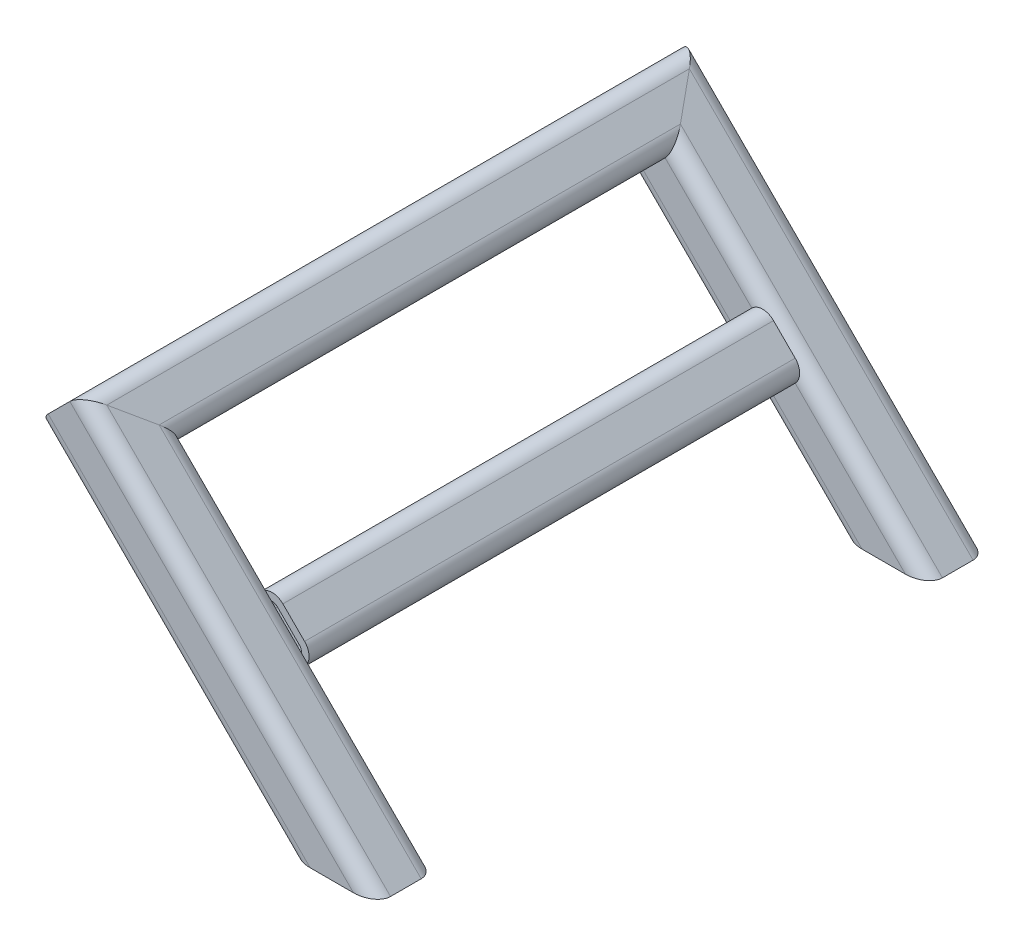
ISO-10303-21;
HEADER;
FILE_DESCRIPTION(('STEP AP214'),'2;1');
FILE_NAME('part.step','',(''),(''),'','','');
FILE_SCHEMA(('AUTOMOTIVE_DESIGN { 1 0 10303 214 1 1 1 1 }'));
ENDSEC;
DATA;
#1=APPLICATION_CONTEXT('core data for automotive mechanical design processes');
#2=APPLICATION_PROTOCOL_DEFINITION('international standard','automotive_design',2000,#1);
#3=PRODUCT_CONTEXT('',#1,'mechanical');
#4=PRODUCT('Part','Part','',(#3));
#5=PRODUCT_RELATED_PRODUCT_CATEGORY('part','',(#4));
#6=PRODUCT_DEFINITION_FORMATION('','',#4);
#7=PRODUCT_DEFINITION_CONTEXT('part definition',#1,'design');
#8=PRODUCT_DEFINITION('design','',#6,#7);
#9=PRODUCT_DEFINITION_SHAPE('','',#8);
#10=(LENGTH_UNIT() NAMED_UNIT(*) SI_UNIT(.MILLI.,.METRE.));
#11=(NAMED_UNIT(*) PLANE_ANGLE_UNIT() SI_UNIT($,.RADIAN.));
#12=(NAMED_UNIT(*) SI_UNIT($,.STERADIAN.) SOLID_ANGLE_UNIT());
#13=UNCERTAINTY_MEASURE_WITH_UNIT(LENGTH_MEASURE(1.E-05),#10,'distance_accuracy_value','');
#14=(GEOMETRIC_REPRESENTATION_CONTEXT(3) GLOBAL_UNCERTAINTY_ASSIGNED_CONTEXT((#13)) GLOBAL_UNIT_ASSIGNED_CONTEXT((#10,
#11,#12)) REPRESENTATION_CONTEXT('',''));
#15=CARTESIAN_POINT('',(0.,0.,0.));
#16=DIRECTION('',(0.,0.,1.));
#17=DIRECTION('',(1.,0.,0.));
#18=AXIS2_PLACEMENT_3D('',#15,#16,#17);
#19=CARTESIAN_POINT('',(26.9407683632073,26.9407683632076,469.9));
#20=DIRECTION('',(-0.707106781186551,0.707106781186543,0.));
#21=DIRECTION('',(-0.707106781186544,-0.707106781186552,0.));
#22=AXIS2_PLACEMENT_3D('',#19,#20,#21);
#23=CYLINDRICAL_SURFACE('',#22,6.35000000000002);
#24=CARTESIAN_POINT('',(28.481536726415,25.4,469.9));
#25=DIRECTION('',(0.,1.,0.));
#26=DIRECTION('',(-1.,0.,0.));
#27=AXIS2_PLACEMENT_3D('',#24,#25,#26);
#28=ELLIPSE('',#27,8.98025612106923,6.35000000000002);
#29=CARTESIAN_POINT('',(28.481536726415,25.4,476.25));
#30=VERTEX_POINT('',#29);
#31=CARTESIAN_POINT('',(37.4617928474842,25.4,469.9));
#32=VERTEX_POINT('',#31);
#33=EDGE_CURVE('E12',#30,#32,#28,.T.);
#34=ORIENTED_EDGE('',*,*,#33,.F.);
#35=DIRECTION('',(-0.707106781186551,0.707106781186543,0.));
#36=VECTOR('',#35,1.);
#37=CARTESIAN_POINT('',(26.9407683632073,26.9407683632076,476.25));
#38=LINE('',#37,#36);
#39=CARTESIAN_POINT('',(-202.055762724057,255.93729945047,476.25));
#40=VERTEX_POINT('',#39);
#41=EDGE_CURVE('E205',#30,#40,#38,.T.);
#42=ORIENTED_EDGE('',*,*,#41,.T.);
#43=CARTESIAN_POINT('',(-197.565634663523,251.447171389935,469.9));
#44=DIRECTION('',(0.500000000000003,-0.499999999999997,0.707106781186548));
#45=DIRECTION('',(-0.500000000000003,0.499999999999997,0.707106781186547));
#46=AXIS2_PLACEMENT_3D('',#43,#44,#45);
#47=ELLIPSE('',#46,8.98025612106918,6.35000000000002);
#48=CARTESIAN_POINT('',(-193.075506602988,255.93729945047,469.9));
#49=VERTEX_POINT('',#48);
#50=EDGE_CURVE('E180',#49,#40,#47,.T.);
#51=ORIENTED_EDGE('',*,*,#50,.F.);
#52=DIRECTION('',(-0.707106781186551,0.707106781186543,0.));
#53=VECTOR('',#52,1.);
#54=CARTESIAN_POINT('',(31.4308964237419,31.4308964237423,469.9));
#55=LINE('',#54,#53);
#56=EDGE_CURVE('E168',#32,#49,#55,.T.);
#57=ORIENTED_EDGE('',*,*,#56,.F.);
#58=EDGE_LOOP('',(#34,#42,#51,#57));
#59=FACE_BOUND('',#58,.T.);
#60=ADVANCED_FACE('F41',(#59),#23,.F.);
#61=CARTESIAN_POINT('',(31.4308964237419,31.4308964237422,444.5));
#62=DIRECTION('',(-0.707106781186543,-0.707106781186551,0.));
#63=DIRECTION('',(0.707106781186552,-0.707106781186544,0.));
#64=AXIS2_PLACEMENT_3D('',#61,#62,#63);
#65=PLANE('',#64);
#66=DIRECTION('',(0.,0.,-1.));
#67=VECTOR('',#66,1.);
#68=CARTESIAN_POINT('',(37.4617928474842,25.4,444.5));
#69=LINE('',#68,#67);
#70=CARTESIAN_POINT('',(37.4617928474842,25.4,444.5));
#71=VERTEX_POINT('',#70);
#72=EDGE_CURVE('E260',#32,#71,#69,.T.);
#73=ORIENTED_EDGE('',*,*,#72,.F.);
#74=ORIENTED_EDGE('',*,*,#56,.T.);
#75=DIRECTION('',(-0.500000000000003,0.499999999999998,0.707106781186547));
#76=VECTOR('',#75,1.);
#77=CARTESIAN_POINT('',(-71.842048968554,134.703841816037,298.45));
#78=LINE('',#77,#76);
#79=CARTESIAN_POINT('',(-175.11499436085,237.976787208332,444.5));
#80=VERTEX_POINT('',#79);
#81=EDGE_CURVE('E219',#80,#49,#78,.T.);
#82=ORIENTED_EDGE('',*,*,#81,.F.);
#83=DIRECTION('',(-0.707106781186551,0.707106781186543,0.));
#84=VECTOR('',#83,1.);
#85=CARTESIAN_POINT('',(31.4308964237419,31.4308964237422,444.5));
#86=LINE('',#85,#84);
#87=EDGE_CURVE('E193',#71,#80,#86,.T.);
#88=ORIENTED_EDGE('',*,*,#87,.F.);
#89=EDGE_LOOP('',(#73,#74,#82,#88));
#90=FACE_BOUND('',#89,.T.);
#91=ADVANCED_FACE('F308',(#90),#65,.T.);
#92=CARTESIAN_POINT('',(26.9407683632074,26.9407683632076,444.5));
#93=DIRECTION('',(-0.707106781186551,0.707106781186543,0.));
#94=DIRECTION('',(-0.707106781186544,-0.707106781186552,0.));
#95=AXIS2_PLACEMENT_3D('',#92,#93,#94);
#96=CYLINDRICAL_SURFACE('',#95,6.35);
#97=CARTESIAN_POINT('',(28.481536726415,25.4,444.5));
#98=DIRECTION('',(0.,1.,0.));
#99=DIRECTION('',(-1.,0.,0.));
#100=AXIS2_PLACEMENT_3D('',#97,#98,#99);
#101=ELLIPSE('',#100,8.9802561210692,6.35);
#102=CARTESIAN_POINT('',(28.481536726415,25.4,438.15));
#103=VERTEX_POINT('',#102);
#104=EDGE_CURVE('E258',#71,#103,#101,.T.);
#105=ORIENTED_EDGE('',*,*,#104,.F.);
#106=ORIENTED_EDGE('',*,*,#87,.T.);
#107=CARTESIAN_POINT('',(-179.605122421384,233.486659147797,444.5));
#108=DIRECTION('',(0.500000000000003,-0.499999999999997,0.707106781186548));
#109=DIRECTION('',(-0.500000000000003,0.499999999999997,0.707106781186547));
#110=AXIS2_PLACEMENT_3D('',#107,#108,#109);
#111=ELLIPSE('',#110,8.98025612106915,6.35);
#112=CARTESIAN_POINT('',(-175.11499436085,228.996531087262,438.15));
#113=VERTEX_POINT('',#112);
#114=EDGE_CURVE('E222',#113,#80,#111,.T.);
#115=ORIENTED_EDGE('',*,*,#114,.F.);
#116=DIRECTION('',(-0.707106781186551,0.707106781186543,0.));
#117=VECTOR('',#116,1.);
#118=CARTESIAN_POINT('',(26.9407683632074,26.9407683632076,438.15));
#119=LINE('',#118,#117);
#120=EDGE_CURVE('E195',#103,#113,#119,.T.);
#121=ORIENTED_EDGE('',*,*,#120,.F.);
#122=EDGE_LOOP('',(#105,#106,#115,#121));
#123=FACE_BOUND('',#122,.T.);
#124=ADVANCED_FACE('F313',(#123),#96,.F.);
#125=CARTESIAN_POINT('',(26.9407683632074,26.9407683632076,438.15));
#126=DIRECTION('',(0.,0.,1.));
#127=DIRECTION('',(1.,0.,0.));
#128=AXIS2_PLACEMENT_3D('',#125,#126,#127);
#129=PLANE('',#128);
#130=DIRECTION('',(-1.,0.,0.));
#131=VECTOR('',#130,1.);
#132=CARTESIAN_POINT('',(26.9407683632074,25.4,438.15));
#133=LINE('',#132,#131);
#134=CARTESIAN_POINT('',(-7.43948775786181,25.4,438.15));
#135=VERTEX_POINT('',#134);
#136=EDGE_CURVE('E256',#103,#135,#133,.T.);
#137=ORIENTED_EDGE('',*,*,#136,.F.);
#138=ORIENTED_EDGE('',*,*,#120,.T.);
#139=DIRECTION('',(0.707106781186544,0.707106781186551,0.));
#140=VECTOR('',#139,1.);
#141=CARTESIAN_POINT('',(-175.11499436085,228.996531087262,438.15));
#142=LINE('',#141,#140);
#143=CARTESIAN_POINT('',(-193.075506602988,211.036018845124,438.15));
#144=VERTEX_POINT('',#143);
#145=EDGE_CURVE('E225',#144,#113,#142,.T.);
#146=ORIENTED_EDGE('',*,*,#145,.F.);
#147=DIRECTION('',(-0.707106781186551,0.707106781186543,0.));
#148=VECTOR('',#147,1.);
#149=CARTESIAN_POINT('',(8.98025612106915,8.98025612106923,438.15));
#150=LINE('',#149,#148);
#151=EDGE_CURVE('E197',#135,#144,#150,.T.);
#152=ORIENTED_EDGE('',*,*,#151,.F.);
#153=EDGE_LOOP('',(#137,#138,#146,#152));
#154=FACE_BOUND('',#153,.T.);
#155=ADVANCED_FACE('F331',(#154),#129,.T.);
#156=CARTESIAN_POINT('',(8.98025612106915,8.98025612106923,444.5));
#157=DIRECTION('',(-0.707106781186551,0.707106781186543,0.));
#158=DIRECTION('',(-0.707106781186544,-0.707106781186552,0.));
#159=AXIS2_PLACEMENT_3D('',#156,#157,#158);
#160=CYLINDRICAL_SURFACE('',#159,6.35000000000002);
#161=CARTESIAN_POINT('',(-7.43948775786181,25.4,444.5));
#162=DIRECTION('',(0.,1.,0.));
#163=DIRECTION('',(-1.,0.,0.));
#164=AXIS2_PLACEMENT_3D('',#161,#162,#163);
#165=ELLIPSE('',#164,8.98025612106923,6.35000000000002);
#166=CARTESIAN_POINT('',(-16.419743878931,25.4,444.5));
#167=VERTEX_POINT('',#166);
#168=EDGE_CURVE('E95',#135,#167,#165,.T.);
#169=ORIENTED_EDGE('',*,*,#168,.F.);
#170=ORIENTED_EDGE('',*,*,#151,.T.);
#171=CARTESIAN_POINT('',(-197.565634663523,215.526146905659,444.5));
#172=DIRECTION('',(0.500000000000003,-0.499999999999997,0.707106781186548));
#173=DIRECTION('',(-0.500000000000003,0.499999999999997,0.707106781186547));
#174=AXIS2_PLACEMENT_3D('',#171,#172,#173);
#175=ELLIPSE('',#174,8.98025612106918,6.35000000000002);
#176=CARTESIAN_POINT('',(-202.055762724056,211.036018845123,444.499999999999));
#177=VERTEX_POINT('',#176);
#178=EDGE_CURVE('E228',#177,#144,#175,.T.);
#179=ORIENTED_EDGE('',*,*,#178,.F.);
#180=DIRECTION('',(-0.707106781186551,0.707106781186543,0.));
#181=VECTOR('',#180,1.);
#182=CARTESIAN_POINT('',(4.49012806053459,4.49012806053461,444.5));
#183=LINE('',#182,#181);
#184=EDGE_CURVE('E199',#167,#177,#183,.T.);
#185=ORIENTED_EDGE('',*,*,#184,.F.);
#186=EDGE_LOOP('',(#169,#170,#179,#185));
#187=FACE_BOUND('',#186,.T.);
#188=ADVANCED_FACE('F334',(#187),#160,.F.);
#189=CARTESIAN_POINT('',(4.49012806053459,4.49012806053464,469.9));
#190=DIRECTION('',(0.707106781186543,0.707106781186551,0.));
#191=DIRECTION('',(-0.707106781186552,0.707106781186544,0.));
#192=AXIS2_PLACEMENT_3D('',#189,#190,#191);
#193=PLANE('',#192);
#194=DIRECTION('',(0.,0.,1.));
#195=VECTOR('',#194,1.);
#196=CARTESIAN_POINT('',(-16.419743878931,25.4,469.9));
#197=LINE('',#196,#195);
#198=CARTESIAN_POINT('',(-16.419743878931,25.4,469.900000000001));
#199=VERTEX_POINT('',#198);
#200=EDGE_CURVE('E98',#167,#199,#197,.T.);
#201=ORIENTED_EDGE('',*,*,#200,.F.);
#202=ORIENTED_EDGE('',*,*,#184,.T.);
#203=DIRECTION('',(0.500000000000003,-0.499999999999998,-0.707106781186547));
#204=VECTOR('',#203,1.);
#205=CARTESIAN_POINT('',(-107.763073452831,116.743329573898,311.15));
#206=LINE('',#205,#204);
#207=CARTESIAN_POINT('',(-220.016274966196,228.996531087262,469.9));
#208=VERTEX_POINT('',#207);
#209=EDGE_CURVE('E187',#208,#177,#206,.T.);
#210=ORIENTED_EDGE('',*,*,#209,.F.);
#211=DIRECTION('',(-0.707106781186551,0.707106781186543,0.));
#212=VECTOR('',#211,1.);
#213=CARTESIAN_POINT('',(4.49012806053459,4.49012806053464,469.9));
#214=LINE('',#213,#212);
#215=EDGE_CURVE('E201',#199,#208,#214,.T.);
#216=ORIENTED_EDGE('',*,*,#215,.F.);
#217=EDGE_LOOP('',(#201,#202,#210,#216));
#218=FACE_BOUND('',#217,.T.);
#219=ADVANCED_FACE('F337',(#218),#193,.T.);
#220=CARTESIAN_POINT('',(8.98025612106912,8.98025612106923,469.9));
#221=DIRECTION('',(-0.707106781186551,0.707106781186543,0.));
#222=DIRECTION('',(-0.707106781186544,-0.707106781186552,0.));
#223=AXIS2_PLACEMENT_3D('',#220,#221,#222);
#224=CYLINDRICAL_SURFACE('',#223,6.35);
#225=CARTESIAN_POINT('',(-7.43948775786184,25.4,469.9));
#226=DIRECTION('',(0.,1.,0.));
#227=DIRECTION('',(-1.,0.,0.));
#228=AXIS2_PLACEMENT_3D('',#225,#226,#227);
#229=ELLIPSE('',#228,8.9802561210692,6.35);
#230=CARTESIAN_POINT('',(-7.43948775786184,25.4,476.25));
#231=VERTEX_POINT('',#230);
#232=EDGE_CURVE('E102',#199,#231,#229,.T.);
#233=ORIENTED_EDGE('',*,*,#232,.F.);
#234=ORIENTED_EDGE('',*,*,#215,.T.);
#235=CARTESIAN_POINT('',(-215.526146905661,233.486659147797,469.9));
#236=DIRECTION('',(0.500000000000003,-0.499999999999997,0.707106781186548));
#237=DIRECTION('',(-0.500000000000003,0.499999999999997,0.707106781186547));
#238=AXIS2_PLACEMENT_3D('',#235,#236,#237);
#239=ELLIPSE('',#238,8.98025612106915,6.35);
#240=CARTESIAN_POINT('',(-220.016274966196,237.976787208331,476.25));
#241=VERTEX_POINT('',#240);
#242=EDGE_CURVE('E184',#241,#208,#239,.T.);
#243=ORIENTED_EDGE('',*,*,#242,.F.);
#244=DIRECTION('',(-0.707106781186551,0.707106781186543,0.));
#245=VECTOR('',#244,1.);
#246=CARTESIAN_POINT('',(8.98025612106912,8.98025612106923,476.25));
#247=LINE('',#246,#245);
#248=EDGE_CURVE('E203',#231,#241,#247,.T.);
#249=ORIENTED_EDGE('',*,*,#248,.F.);
#250=EDGE_LOOP('',(#233,#234,#243,#249));
#251=FACE_BOUND('',#250,.T.);
#252=ADVANCED_FACE('F343',(#251),#224,.F.);
#253=CARTESIAN_POINT('',(8.98025612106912,8.98025612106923,476.25));
#254=DIRECTION('',(0.,0.,-1.));
#255=DIRECTION('',(-1.,0.,0.));
#256=AXIS2_PLACEMENT_3D('',#253,#254,#255);
#257=PLANE('',#256);
#258=DIRECTION('',(1.,0.,0.));
#259=VECTOR('',#258,1.);
#260=CARTESIAN_POINT('',(8.98025612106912,25.4,476.25));
#261=LINE('',#260,#259);
#262=EDGE_CURVE('E105',#231,#30,#261,.T.);
#263=ORIENTED_EDGE('',*,*,#262,.F.);
#264=ORIENTED_EDGE('',*,*,#248,.T.);
#265=DIRECTION('',(-0.707106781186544,-0.707106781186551,0.));
#266=VECTOR('',#265,1.);
#267=CARTESIAN_POINT('',(-220.016274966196,237.976787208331,476.25));
#268=LINE('',#267,#266);
#269=EDGE_CURVE('E233',#40,#241,#268,.T.);
#270=ORIENTED_EDGE('',*,*,#269,.F.);
#271=ORIENTED_EDGE('',*,*,#41,.F.);
#272=EDGE_LOOP('',(#263,#264,#270,#271));
#273=FACE_BOUND('',#272,.T.);
#274=ADVANCED_FACE('F345',(#273),#257,.T.);
#275=CARTESIAN_POINT('',(-215.526146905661,215.526146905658,457.2));
#276=DIRECTION('',(0.500000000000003,-0.499999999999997,0.707106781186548));
#277=DIRECTION('',(0.816496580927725,0.,-0.577350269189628));
#278=AXIS2_PLACEMENT_3D('',#275,#276,#277);
#279=PLANE('',#278);
#280=ORIENTED_EDGE('',*,*,#50,.T.);
#281=ORIENTED_EDGE('',*,*,#269,.T.);
#282=ORIENTED_EDGE('',*,*,#242,.T.);
#283=ORIENTED_EDGE('',*,*,#209,.T.);
#284=ORIENTED_EDGE('',*,*,#178,.T.);
#285=ORIENTED_EDGE('',*,*,#145,.T.);
#286=ORIENTED_EDGE('',*,*,#114,.T.);
#287=ORIENTED_EDGE('',*,*,#81,.T.);
#288=EDGE_LOOP('',(#280,#281,#282,#283,#284,#285,#286,#287));
#289=FACE_BOUND('',#288,.T.);
#290=DIRECTION('',(0.707106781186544,0.707106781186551,0.));
#291=VECTOR('',#290,1.);
#292=CARTESIAN_POINT('',(-170.624866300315,224.506403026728,431.8));
#293=LINE('',#292,#291);
#294=CARTESIAN_POINT('',(-188.585378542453,206.545890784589,431.8));
#295=VERTEX_POINT('',#294);
#296=CARTESIAN_POINT('',(-170.624866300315,224.506403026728,431.8));
#297=VERTEX_POINT('',#296);
#298=EDGE_CURVE('E175',#295,#297,#293,.T.);
#299=ORIENTED_EDGE('',*,*,#298,.F.);
#300=CARTESIAN_POINT('',(-197.565634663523,215.526146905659,444.5));
#301=DIRECTION('',(0.500000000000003,-0.499999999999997,0.707106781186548));
#302=DIRECTION('',(-0.500000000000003,0.499999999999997,0.707106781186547));
#303=AXIS2_PLACEMENT_3D('',#300,#301,#302);
#304=ELLIPSE('',#303,17.9605122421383,12.7);
#305=CARTESIAN_POINT('',(-206.545890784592,206.545890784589,444.5));
#306=VERTEX_POINT('',#305);
#307=EDGE_CURVE('E235',#306,#295,#304,.T.);
#308=ORIENTED_EDGE('',*,*,#307,.F.);
#309=DIRECTION('',(0.500000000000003,-0.499999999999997,-0.707106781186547));
#310=VECTOR('',#309,1.);
#311=CARTESIAN_POINT('',(-112.253201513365,112.253201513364,311.15));
#312=LINE('',#311,#310);
#313=CARTESIAN_POINT('',(-224.50640302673,224.506403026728,469.9));
#314=VERTEX_POINT('',#313);
#315=EDGE_CURVE('E247',#314,#306,#312,.T.);
#316=ORIENTED_EDGE('',*,*,#315,.F.);
#317=CARTESIAN_POINT('',(-215.526146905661,233.486659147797,469.9));
#318=DIRECTION('',(0.500000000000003,-0.499999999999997,0.707106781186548));
#319=DIRECTION('',(-0.500000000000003,0.499999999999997,0.707106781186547));
#320=AXIS2_PLACEMENT_3D('',#317,#318,#319);
#321=ELLIPSE('',#320,17.9605122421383,12.7);
#322=CARTESIAN_POINT('',(-224.50640302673,242.466915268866,482.6));
#323=VERTEX_POINT('',#322);
#324=EDGE_CURVE('E244',#323,#314,#321,.T.);
#325=ORIENTED_EDGE('',*,*,#324,.F.);
#326=DIRECTION('',(-0.707106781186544,-0.707106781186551,0.));
#327=VECTOR('',#326,1.);
#328=CARTESIAN_POINT('',(-224.50640302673,242.466915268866,482.6));
#329=LINE('',#328,#327);
#330=CARTESIAN_POINT('',(-206.545890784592,260.427427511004,482.6));
#331=VERTEX_POINT('',#330);
#332=EDGE_CURVE('E241',#331,#323,#329,.T.);
#333=ORIENTED_EDGE('',*,*,#332,.F.);
#334=CARTESIAN_POINT('',(-197.565634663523,251.447171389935,469.9));
#335=DIRECTION('',(0.500000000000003,-0.499999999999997,0.707106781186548));
#336=DIRECTION('',(-0.500000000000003,0.499999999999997,0.707106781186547));
#337=AXIS2_PLACEMENT_3D('',#334,#335,#336);
#338=ELLIPSE('',#337,17.9605122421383,12.7);
#339=CARTESIAN_POINT('',(-188.585378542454,260.427427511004,469.9));
#340=VERTEX_POINT('',#339);
#341=EDGE_CURVE('E238',#340,#331,#338,.T.);
#342=ORIENTED_EDGE('',*,*,#341,.F.);
#343=DIRECTION('',(-0.500000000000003,0.499999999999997,0.707106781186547));
#344=VECTOR('',#343,1.);
#345=CARTESIAN_POINT('',(-67.3519209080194,139.193969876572,298.45));
#346=LINE('',#345,#344);
#347=CARTESIAN_POINT('',(-170.624866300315,242.466915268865,444.499999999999));
#348=VERTEX_POINT('',#347);
#349=EDGE_CURVE('E179',#348,#340,#346,.T.);
#350=ORIENTED_EDGE('',*,*,#349,.F.);
#351=CARTESIAN_POINT('',(-179.605122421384,233.486659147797,444.5));
#352=DIRECTION('',(0.500000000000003,-0.499999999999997,0.707106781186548));
#353=DIRECTION('',(-0.500000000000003,0.499999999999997,0.707106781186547));
#354=AXIS2_PLACEMENT_3D('',#351,#352,#353);
#355=ELLIPSE('',#354,17.9605122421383,12.7);
#356=EDGE_CURVE('E163',#297,#348,#355,.T.);
#357=ORIENTED_EDGE('',*,*,#356,.F.);
#358=EDGE_LOOP('',(#299,#308,#316,#325,#333,#342,#350,#357));
#359=FACE_BOUND('',#358,.T.);
#360=ADVANCED_FACE('F173',(#289,#359),#279,.F.);
#361=CARTESIAN_POINT('',(26.9407683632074,26.9407683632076,444.5));
#362=DIRECTION('',(-0.707106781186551,0.707106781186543,0.));
#363=DIRECTION('',(-0.707106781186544,-0.707106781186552,0.));
#364=AXIS2_PLACEMENT_3D('',#361,#362,#363);
#365=CYLINDRICAL_SURFACE('',#364,12.7);
#366=DIRECTION('',(-0.707106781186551,0.707106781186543,0.));
#367=VECTOR('',#366,1.);
#368=CARTESIAN_POINT('',(35.9210244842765,35.9210244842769,444.5));
#369=LINE('',#368,#367);
#370=CARTESIAN_POINT('',(46.4420489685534,25.4,444.5));
#371=VERTEX_POINT('',#370);
#372=EDGE_CURVE('E185',#371,#348,#369,.T.);
#373=ORIENTED_EDGE('',*,*,#372,.F.);
#374=CARTESIAN_POINT('',(28.481536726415,25.4,444.5));
#375=DIRECTION('',(0.,1.,0.));
#376=DIRECTION('',(-1.,0.,0.));
#377=AXIS2_PLACEMENT_3D('',#374,#375,#376);
#378=ELLIPSE('',#377,17.9605122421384,12.7);
#379=CARTESIAN_POINT('',(28.481536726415,25.4,431.8));
#380=VERTEX_POINT('',#379);
#381=EDGE_CURVE('E44',#371,#380,#378,.T.);
#382=ORIENTED_EDGE('',*,*,#381,.T.);
#383=DIRECTION('',(-0.707106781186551,0.707106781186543,0.));
#384=VECTOR('',#383,1.);
#385=CARTESIAN_POINT('',(26.9407683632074,26.9407683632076,431.8));
#386=LINE('',#385,#384);
#387=EDGE_CURVE('E159',#380,#297,#386,.T.);
#388=ORIENTED_EDGE('',*,*,#387,.T.);
#389=ORIENTED_EDGE('',*,*,#356,.T.);
#390=EDGE_LOOP('',(#373,#382,#388,#389));
#391=FACE_BOUND('',#390,.T.);
#392=ADVANCED_FACE('F162',(#391),#365,.T.);
#393=CARTESIAN_POINT('',(35.9210244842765,35.9210244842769,444.5));
#394=DIRECTION('',(-0.707106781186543,-0.707106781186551,0.));
#395=DIRECTION('',(0.707106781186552,-0.707106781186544,0.));
#396=AXIS2_PLACEMENT_3D('',#393,#394,#395);
#397=PLANE('',#396);
#398=DIRECTION('',(-0.707106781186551,0.707106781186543,0.));
#399=VECTOR('',#398,1.);
#400=CARTESIAN_POINT('',(35.9210244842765,35.9210244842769,469.9));
#401=LINE('',#400,#399);
#402=CARTESIAN_POINT('',(46.4420489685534,25.4,469.900000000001));
#403=VERTEX_POINT('',#402);
#404=EDGE_CURVE('E189',#403,#340,#401,.T.);
#405=ORIENTED_EDGE('',*,*,#404,.F.);
#406=DIRECTION('',(0.,0.,-1.));
#407=VECTOR('',#406,1.);
#408=CARTESIAN_POINT('',(46.4420489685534,25.4,444.5));
#409=LINE('',#408,#407);
#410=EDGE_CURVE('E50',#403,#371,#409,.T.);
#411=ORIENTED_EDGE('',*,*,#410,.T.);
#412=ORIENTED_EDGE('',*,*,#372,.T.);
#413=ORIENTED_EDGE('',*,*,#349,.T.);
#414=EDGE_LOOP('',(#405,#411,#412,#413));
#415=FACE_BOUND('',#414,.T.);
#416=ADVANCED_FACE('F280',(#415),#397,.F.);
#417=CARTESIAN_POINT('',(26.9407683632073,26.9407683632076,469.9));
#418=DIRECTION('',(-0.707106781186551,0.707106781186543,0.));
#419=DIRECTION('',(-0.707106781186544,-0.707106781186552,0.));
#420=AXIS2_PLACEMENT_3D('',#417,#418,#419);
#421=CYLINDRICAL_SURFACE('',#420,12.7);
#422=DIRECTION('',(-0.707106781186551,0.707106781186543,0.));
#423=VECTOR('',#422,1.);
#424=CARTESIAN_POINT('',(26.9407683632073,26.9407683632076,482.6));
#425=LINE('',#424,#423);
#426=CARTESIAN_POINT('',(28.481536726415,25.4,482.6));
#427=VERTEX_POINT('',#426);
#428=EDGE_CURVE('E208',#427,#331,#425,.T.);
#429=ORIENTED_EDGE('',*,*,#428,.F.);
#430=CARTESIAN_POINT('',(28.481536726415,25.4,469.9));
#431=DIRECTION('',(0.,1.,0.));
#432=DIRECTION('',(-1.,0.,0.));
#433=AXIS2_PLACEMENT_3D('',#430,#431,#432);
#434=ELLIPSE('',#433,17.9605122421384,12.7);
#435=EDGE_CURVE('E275',#427,#403,#434,.T.);
#436=ORIENTED_EDGE('',*,*,#435,.T.);
#437=ORIENTED_EDGE('',*,*,#404,.T.);
#438=ORIENTED_EDGE('',*,*,#341,.T.);
#439=EDGE_LOOP('',(#429,#436,#437,#438));
#440=FACE_BOUND('',#439,.T.);
#441=ADVANCED_FACE('F285',(#440),#421,.T.);
#442=CARTESIAN_POINT('',(8.98025612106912,8.98025612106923,482.6));
#443=DIRECTION('',(0.,0.,-1.));
#444=DIRECTION('',(-1.,0.,0.));
#445=AXIS2_PLACEMENT_3D('',#442,#443,#444);
#446=PLANE('',#445);
#447=DIRECTION('',(-0.707106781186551,0.707106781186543,0.));
#448=VECTOR('',#447,1.);
#449=CARTESIAN_POINT('',(8.98025612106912,8.98025612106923,482.6));
#450=LINE('',#449,#448);
#451=CARTESIAN_POINT('',(-7.43948775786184,25.4,482.6));
#452=VERTEX_POINT('',#451);
#453=EDGE_CURVE('E210',#452,#323,#450,.T.);
#454=ORIENTED_EDGE('',*,*,#453,.F.);
#455=DIRECTION('',(1.,0.,0.));
#456=VECTOR('',#455,1.);
#457=CARTESIAN_POINT('',(8.98025612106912,25.4,482.6));
#458=LINE('',#457,#456);
#459=EDGE_CURVE('E272',#452,#427,#458,.T.);
#460=ORIENTED_EDGE('',*,*,#459,.T.);
#461=ORIENTED_EDGE('',*,*,#428,.T.);
#462=ORIENTED_EDGE('',*,*,#332,.T.);
#463=EDGE_LOOP('',(#454,#460,#461,#462));
#464=FACE_BOUND('',#463,.T.);
#465=ADVANCED_FACE('F288',(#464),#446,.F.);
#466=CARTESIAN_POINT('',(8.98025612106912,8.98025612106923,469.9));
#467=DIRECTION('',(-0.707106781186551,0.707106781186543,0.));
#468=DIRECTION('',(-0.707106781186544,-0.707106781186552,0.));
#469=AXIS2_PLACEMENT_3D('',#466,#467,#468);
#470=CYLINDRICAL_SURFACE('',#469,12.7);
#471=DIRECTION('',(-0.707106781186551,0.707106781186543,0.));
#472=VECTOR('',#471,1.);
#473=CARTESIAN_POINT('',(0.,0.,469.9));
#474=LINE('',#473,#472);
#475=CARTESIAN_POINT('',(-25.4000000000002,25.4,469.9));
#476=VERTEX_POINT('',#475);
#477=EDGE_CURVE('E212',#476,#314,#474,.T.);
#478=ORIENTED_EDGE('',*,*,#477,.F.);
#479=CARTESIAN_POINT('',(-7.43948775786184,25.4,469.9));
#480=DIRECTION('',(0.,1.,0.));
#481=DIRECTION('',(-1.,0.,0.));
#482=AXIS2_PLACEMENT_3D('',#479,#480,#481);
#483=ELLIPSE('',#482,17.9605122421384,12.7);
#484=EDGE_CURVE('E269',#476,#452,#483,.T.);
#485=ORIENTED_EDGE('',*,*,#484,.T.);
#486=ORIENTED_EDGE('',*,*,#453,.T.);
#487=ORIENTED_EDGE('',*,*,#324,.T.);
#488=EDGE_LOOP('',(#478,#485,#486,#487));
#489=FACE_BOUND('',#488,.T.);
#490=ADVANCED_FACE('F292',(#489),#470,.T.);
#491=CARTESIAN_POINT('',(0.,0.,469.9));
#492=DIRECTION('',(0.707106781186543,0.707106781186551,0.));
#493=DIRECTION('',(-0.707106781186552,0.707106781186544,0.));
#494=AXIS2_PLACEMENT_3D('',#491,#492,#493);
#495=PLANE('',#494);
#496=DIRECTION('',(-0.707106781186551,0.707106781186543,0.));
#497=VECTOR('',#496,1.);
#498=CARTESIAN_POINT('',(0.,0.,444.5));
#499=LINE('',#498,#497);
#500=CARTESIAN_POINT('',(-25.4000000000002,25.4,444.5));
#501=VERTEX_POINT('',#500);
#502=EDGE_CURVE('E214',#501,#306,#499,.T.);
#503=ORIENTED_EDGE('',*,*,#502,.F.);
#504=DIRECTION('',(0.,0.,1.));
#505=VECTOR('',#504,1.);
#506=CARTESIAN_POINT('',(-25.4000000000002,25.4,469.9));
#507=LINE('',#506,#505);
#508=EDGE_CURVE('E266',#501,#476,#507,.T.);
#509=ORIENTED_EDGE('',*,*,#508,.T.);
#510=ORIENTED_EDGE('',*,*,#477,.T.);
#511=ORIENTED_EDGE('',*,*,#315,.T.);
#512=EDGE_LOOP('',(#503,#509,#510,#511));
#513=FACE_BOUND('',#512,.T.);
#514=ADVANCED_FACE('F295',(#513),#495,.F.);
#515=CARTESIAN_POINT('',(8.98025612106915,8.98025612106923,444.5));
#516=DIRECTION('',(-0.707106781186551,0.707106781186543,0.));
#517=DIRECTION('',(-0.707106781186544,-0.707106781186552,0.));
#518=AXIS2_PLACEMENT_3D('',#515,#516,#517);
#519=CYLINDRICAL_SURFACE('',#518,12.7);
#520=DIRECTION('',(-0.707106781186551,0.707106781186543,0.));
#521=VECTOR('',#520,1.);
#522=CARTESIAN_POINT('',(8.98025612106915,8.98025612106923,431.8));
#523=LINE('',#522,#521);
#524=CARTESIAN_POINT('',(-7.43948775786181,25.4,431.8));
#525=VERTEX_POINT('',#524);
#526=EDGE_CURVE('E167',#525,#295,#523,.T.);
#527=ORIENTED_EDGE('',*,*,#526,.F.);
#528=CARTESIAN_POINT('',(-7.43948775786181,25.4,444.5));
#529=DIRECTION('',(0.,1.,0.));
#530=DIRECTION('',(-1.,0.,0.));
#531=AXIS2_PLACEMENT_3D('',#528,#529,#530);
#532=ELLIPSE('',#531,17.9605122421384,12.7);
#533=EDGE_CURVE('E263',#525,#501,#532,.T.);
#534=ORIENTED_EDGE('',*,*,#533,.T.);
#535=ORIENTED_EDGE('',*,*,#502,.T.);
#536=ORIENTED_EDGE('',*,*,#307,.T.);
#537=EDGE_LOOP('',(#527,#534,#535,#536));
#538=FACE_BOUND('',#537,.T.);
#539=ADVANCED_FACE('F298',(#538),#519,.T.);
#540=CARTESIAN_POINT('',(26.9407683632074,26.9407683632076,431.8));
#541=DIRECTION('',(0.,0.,1.));
#542=DIRECTION('',(1.,0.,0.));
#543=AXIS2_PLACEMENT_3D('',#540,#541,#542);
#544=PLANE('',#543);
#545=ORIENTED_EDGE('',*,*,#387,.F.);
#546=DIRECTION('',(-1.,0.,0.));
#547=VECTOR('',#546,1.);
#548=CARTESIAN_POINT('',(26.9407683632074,25.4,431.8));
#549=LINE('',#548,#547);
#550=EDGE_CURVE('E252',#380,#525,#549,.T.);
#551=ORIENTED_EDGE('',*,*,#550,.T.);
#552=ORIENTED_EDGE('',*,*,#526,.T.);
#553=ORIENTED_EDGE('',*,*,#298,.T.);
#554=EDGE_LOOP('',(#545,#551,#552,#553));
#555=FACE_BOUND('',#554,.T.);
#556=ADVANCED_FACE('F182',(#555),#544,.F.);
#557=CARTESIAN_POINT('',(152.4,25.4,457.2));
#558=DIRECTION('',(0.,1.,0.));
#559=DIRECTION('',(0.,0.,1.));
#560=AXIS2_PLACEMENT_3D('',#557,#558,#559);
#561=PLANE('',#560);
#562=ORIENTED_EDGE('',*,*,#262,.T.);
#563=ORIENTED_EDGE('',*,*,#33,.T.);
#564=ORIENTED_EDGE('',*,*,#72,.T.);
#565=ORIENTED_EDGE('',*,*,#104,.T.);
#566=ORIENTED_EDGE('',*,*,#136,.T.);
#567=ORIENTED_EDGE('',*,*,#168,.T.);
#568=ORIENTED_EDGE('',*,*,#200,.T.);
#569=ORIENTED_EDGE('',*,*,#232,.T.);
#570=EDGE_LOOP('',(#562,#563,#564,#565,#566,#567,#568,#569));
#571=FACE_BOUND('',#570,.T.);
#572=ORIENTED_EDGE('',*,*,#381,.F.);
#573=ORIENTED_EDGE('',*,*,#410,.F.);
#574=ORIENTED_EDGE('',*,*,#435,.F.);
#575=ORIENTED_EDGE('',*,*,#459,.F.);
#576=ORIENTED_EDGE('',*,*,#484,.F.);
#577=ORIENTED_EDGE('',*,*,#508,.F.);
#578=ORIENTED_EDGE('',*,*,#533,.F.);
#579=ORIENTED_EDGE('',*,*,#550,.F.);
#580=EDGE_LOOP('',(#572,#573,#574,#575,#576,#577,#578,#579));
#581=FACE_BOUND('',#580,.T.);
#582=ADVANCED_FACE('F281',(#571,#581),#561,.F.);
#583=CLOSED_SHELL('',(#60,#91,#124,#155,#188,#219,#252,#274,#360,#392,#416,#441,#465,#490,#514,
#539,#556,#582));
#584=MANIFOLD_SOLID_BREP('B2',#583);
#585=CARTESIAN_POINT('',(-220.016274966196,237.976787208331,457.2));
#586=DIRECTION('',(0.707106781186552,-0.707106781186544,0.));
#587=DIRECTION('',(0.707106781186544,0.707106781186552,0.));
#588=AXIS2_PLACEMENT_3D('',#585,#586,#587);
#589=PLANE('',#588);
#590=DIRECTION('',(-0.707106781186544,-0.707106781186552,0.));
#591=VECTOR('',#590,1.);
#592=CARTESIAN_POINT('',(-220.016274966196,237.976787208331,-19.05));
#593=LINE('',#592,#591);
#594=CARTESIAN_POINT('',(-202.055762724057,255.93729945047,-19.05));
#595=VERTEX_POINT('',#594);
#596=CARTESIAN_POINT('',(-220.016274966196,237.976787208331,-19.05));
#597=VERTEX_POINT('',#596);
#598=EDGE_CURVE('E39',#595,#597,#593,.T.);
#599=ORIENTED_EDGE('',*,*,#598,.F.);
#600=DIRECTION('',(0.,0.,-1.));
#601=VECTOR('',#600,1.);
#602=CARTESIAN_POINT('',(-202.055762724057,255.93729945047,457.2));
#603=LINE('',#602,#601);
#604=CARTESIAN_POINT('',(-202.055762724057,255.93729945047,476.25));
#605=VERTEX_POINT('',#604);
#606=EDGE_CURVE('E630',#605,#595,#603,.T.);
#607=ORIENTED_EDGE('',*,*,#606,.F.);
#608=DIRECTION('',(-0.707106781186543,-0.707106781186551,0.));
#609=VECTOR('',#608,1.);
#610=CARTESIAN_POINT('',(-220.016274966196,237.976787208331,476.25));
#611=LINE('',#610,#609);
#612=CARTESIAN_POINT('',(-220.016274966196,237.976787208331,476.25));
#613=VERTEX_POINT('',#612);
#614=EDGE_CURVE('E610',#605,#613,#611,.T.);
#615=ORIENTED_EDGE('',*,*,#614,.T.);
#616=DIRECTION('',(0.,0.,-1.));
#617=VECTOR('',#616,1.);
#618=CARTESIAN_POINT('',(-220.016274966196,237.976787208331,457.2));
#619=LINE('',#618,#617);
#620=EDGE_CURVE('E622',#613,#597,#619,.T.);
#621=ORIENTED_EDGE('',*,*,#620,.T.);
#622=EDGE_LOOP('',(#599,#607,#615,#621));
#623=FACE_BOUND('',#622,.T.);
#624=ADVANCED_FACE('F488',(#623),#589,.T.);
#625=CARTESIAN_POINT('',(-215.526146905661,233.486659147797,457.2));
#626=DIRECTION('',(0.,0.,-1.));
#627=DIRECTION('',(0.,1.,0.));
#628=AXIS2_PLACEMENT_3D('',#625,#626,#627);
#629=CYLINDRICAL_SURFACE('',#628,6.35);
#630=CARTESIAN_POINT('',(-215.526146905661,233.486659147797,-12.7));
#631=DIRECTION('',(-0.500000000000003,0.499999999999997,0.707106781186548));
#632=DIRECTION('',(-0.500000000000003,0.499999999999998,-0.707106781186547));
#633=AXIS2_PLACEMENT_3D('',#630,#631,#632);
#634=ELLIPSE('',#633,8.98025612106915,6.35);
#635=CARTESIAN_POINT('',(-220.016274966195,228.996531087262,-12.7));
#636=VERTEX_POINT('',#635);
#637=EDGE_CURVE('E624',#597,#636,#634,.T.);
#638=ORIENTED_EDGE('',*,*,#637,.F.);
#639=ORIENTED_EDGE('',*,*,#620,.F.);
#640=CARTESIAN_POINT('',(-215.526146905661,233.486659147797,469.9));
#641=DIRECTION('',(0.500000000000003,-0.499999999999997,0.707106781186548));
#642=DIRECTION('',(0.500000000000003,-0.499999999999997,-0.707106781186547));
#643=AXIS2_PLACEMENT_3D('',#640,#641,#642);
#644=ELLIPSE('',#643,8.98025612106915,6.35);
#645=CARTESIAN_POINT('',(-220.016274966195,228.996531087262,469.9));
#646=VERTEX_POINT('',#645);
#647=EDGE_CURVE('E606',#613,#646,#644,.T.);
#648=ORIENTED_EDGE('',*,*,#647,.T.);
#649=DIRECTION('',(0.,0.,-1.));
#650=VECTOR('',#649,1.);
#651=CARTESIAN_POINT('',(-220.016274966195,228.996531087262,457.2));
#652=LINE('',#651,#650);
#653=EDGE_CURVE('E617',#646,#636,#652,.T.);
#654=ORIENTED_EDGE('',*,*,#653,.T.);
#655=EDGE_LOOP('',(#638,#639,#648,#654));
#656=FACE_BOUND('',#655,.T.);
#657=ADVANCED_FACE('F623',(#656),#629,.F.);
#658=CARTESIAN_POINT('',(-220.016274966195,228.996531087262,457.2));
#659=DIRECTION('',(0.707106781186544,0.707106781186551,0.));
#660=DIRECTION('',(-0.707106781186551,0.707106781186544,0.));
#661=AXIS2_PLACEMENT_3D('',#658,#659,#660);
#662=PLANE('',#661);
#663=DIRECTION('',(0.500000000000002,-0.499999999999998,0.707106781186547));
#664=VECTOR('',#663,1.);
#665=CARTESIAN_POINT('',(-53.8815367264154,62.8617928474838,222.25));
#666=LINE('',#665,#664);
#667=CARTESIAN_POINT('',(-202.055762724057,211.036018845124,12.7000000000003));
#668=VERTEX_POINT('',#667);
#669=EDGE_CURVE('E716',#636,#668,#666,.T.);
#670=ORIENTED_EDGE('',*,*,#669,.F.);
#671=ORIENTED_EDGE('',*,*,#653,.F.);
#672=DIRECTION('',(0.500000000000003,-0.499999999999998,-0.707106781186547));
#673=VECTOR('',#672,1.);
#674=CARTESIAN_POINT('',(-215.526146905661,224.506403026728,463.55));
#675=LINE('',#674,#673);
#676=CARTESIAN_POINT('',(-202.055762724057,211.036018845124,444.5));
#677=VERTEX_POINT('',#676);
#678=EDGE_CURVE('E613',#646,#677,#675,.T.);
#679=ORIENTED_EDGE('',*,*,#678,.T.);
#680=DIRECTION('',(0.,0.,-1.));
#681=VECTOR('',#680,1.);
#682=CARTESIAN_POINT('',(-202.055762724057,211.036018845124,457.2));
#683=LINE('',#682,#681);
#684=EDGE_CURVE('E618',#677,#668,#683,.T.);
#685=ORIENTED_EDGE('',*,*,#684,.T.);
#686=EDGE_LOOP('',(#670,#671,#679,#685));
#687=FACE_BOUND('',#686,.T.);
#688=ADVANCED_FACE('F720',(#687),#662,.T.);
#689=CARTESIAN_POINT('',(-197.565634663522,215.526146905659,457.2));
#690=DIRECTION('',(0.,0.,-1.));
#691=DIRECTION('',(0.,1.,0.));
#692=AXIS2_PLACEMENT_3D('',#689,#690,#691);
#693=CYLINDRICAL_SURFACE('',#692,6.35000000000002);
#694=CARTESIAN_POINT('',(-197.565634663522,215.526146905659,12.7));
#695=DIRECTION('',(-0.500000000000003,0.499999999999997,0.707106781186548));
#696=DIRECTION('',(-0.500000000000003,0.499999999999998,-0.707106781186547));
#697=AXIS2_PLACEMENT_3D('',#694,#695,#696);
#698=ELLIPSE('',#697,8.98025612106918,6.35000000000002);
#699=CARTESIAN_POINT('',(-193.075506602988,211.036018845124,19.05));
#700=VERTEX_POINT('',#699);
#701=EDGE_CURVE('E722',#668,#700,#698,.T.);
#702=ORIENTED_EDGE('',*,*,#701,.F.);
#703=ORIENTED_EDGE('',*,*,#684,.F.);
#704=CARTESIAN_POINT('',(-197.565634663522,215.526146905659,444.5));
#705=DIRECTION('',(0.500000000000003,-0.499999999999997,0.707106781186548));
#706=DIRECTION('',(0.500000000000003,-0.499999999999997,-0.707106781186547));
#707=AXIS2_PLACEMENT_3D('',#704,#705,#706);
#708=ELLIPSE('',#707,8.98025612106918,6.35000000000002);
#709=CARTESIAN_POINT('',(-193.075506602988,211.036018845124,438.15));
#710=VERTEX_POINT('',#709);
#711=EDGE_CURVE('E673',#677,#710,#708,.T.);
#712=ORIENTED_EDGE('',*,*,#711,.T.);
#713=DIRECTION('',(0.,0.,-1.));
#714=VECTOR('',#713,1.);
#715=CARTESIAN_POINT('',(-193.075506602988,211.036018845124,457.2));
#716=LINE('',#715,#714);
#717=EDGE_CURVE('E676',#710,#700,#716,.T.);
#718=ORIENTED_EDGE('',*,*,#717,.T.);
#719=EDGE_LOOP('',(#702,#703,#712,#718));
#720=FACE_BOUND('',#719,.T.);
#721=ADVANCED_FACE('F786',(#720),#693,.F.);
#722=CARTESIAN_POINT('',(-175.11499436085,228.996531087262,457.2));
#723=DIRECTION('',(-0.707106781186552,0.707106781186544,0.));
#724=DIRECTION('',(-0.707106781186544,-0.707106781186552,0.));
#725=AXIS2_PLACEMENT_3D('',#722,#723,#724);
#726=PLANE('',#725);
#727=DIRECTION('',(0.707106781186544,0.707106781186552,0.));
#728=VECTOR('',#727,1.);
#729=CARTESIAN_POINT('',(-175.11499436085,228.996531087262,19.0499999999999));
#730=LINE('',#729,#728);
#731=CARTESIAN_POINT('',(-175.11499436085,228.996531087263,19.0499999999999));
#732=VERTEX_POINT('',#731);
#733=EDGE_CURVE('E543',#700,#732,#730,.T.);
#734=ORIENTED_EDGE('',*,*,#733,.F.);
#735=ORIENTED_EDGE('',*,*,#717,.F.);
#736=DIRECTION('',(0.707106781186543,0.707106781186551,0.));
#737=VECTOR('',#736,1.);
#738=CARTESIAN_POINT('',(-175.11499436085,228.996531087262,438.15));
#739=LINE('',#738,#737);
#740=CARTESIAN_POINT('',(-175.11499436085,228.996531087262,438.15));
#741=VERTEX_POINT('',#740);
#742=EDGE_CURVE('E669',#710,#741,#739,.T.);
#743=ORIENTED_EDGE('',*,*,#742,.T.);
#744=DIRECTION('',(0.,0.,-1.));
#745=VECTOR('',#744,1.);
#746=CARTESIAN_POINT('',(-175.11499436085,228.996531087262,457.2));
#747=LINE('',#746,#745);
#748=EDGE_CURVE('E672',#741,#732,#747,.T.);
#749=ORIENTED_EDGE('',*,*,#748,.T.);
#750=EDGE_LOOP('',(#734,#735,#743,#749));
#751=FACE_BOUND('',#750,.T.);
#752=ADVANCED_FACE('F789',(#751),#726,.T.);
#753=CARTESIAN_POINT('',(-179.605122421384,233.486659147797,457.2));
#754=DIRECTION('',(0.,0.,-1.));
#755=DIRECTION('',(0.,1.,0.));
#756=AXIS2_PLACEMENT_3D('',#753,#754,#755);
#757=CYLINDRICAL_SURFACE('',#756,6.35);
#758=CARTESIAN_POINT('',(-179.605122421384,233.486659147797,12.6999999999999));
#759=DIRECTION('',(-0.500000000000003,0.499999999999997,0.707106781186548));
#760=DIRECTION('',(-0.500000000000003,0.499999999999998,-0.707106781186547));
#761=AXIS2_PLACEMENT_3D('',#758,#759,#760);
#762=ELLIPSE('',#761,8.98025612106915,6.35);
#763=CARTESIAN_POINT('',(-175.11499436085,237.976787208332,12.6999999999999));
#764=VERTEX_POINT('',#763);
#765=EDGE_CURVE('E546',#732,#764,#762,.T.);
#766=ORIENTED_EDGE('',*,*,#765,.F.);
#767=ORIENTED_EDGE('',*,*,#748,.F.);
#768=CARTESIAN_POINT('',(-179.605122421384,233.486659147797,444.5));
#769=DIRECTION('',(0.500000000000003,-0.499999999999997,0.707106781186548));
#770=DIRECTION('',(0.500000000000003,-0.499999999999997,-0.707106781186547));
#771=AXIS2_PLACEMENT_3D('',#768,#769,#770);
#772=ELLIPSE('',#771,8.98025612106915,6.35);
#773=CARTESIAN_POINT('',(-175.11499436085,237.976787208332,444.5));
#774=VERTEX_POINT('',#773);
#775=EDGE_CURVE('E665',#741,#774,#772,.T.);
#776=ORIENTED_EDGE('',*,*,#775,.T.);
#777=DIRECTION('',(0.,0.,-1.));
#778=VECTOR('',#777,1.);
#779=CARTESIAN_POINT('',(-175.11499436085,237.976787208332,457.2));
#780=LINE('',#779,#778);
#781=EDGE_CURVE('E668',#774,#764,#780,.T.);
#782=ORIENTED_EDGE('',*,*,#781,.T.);
#783=EDGE_LOOP('',(#766,#767,#776,#782));
#784=FACE_BOUND('',#783,.T.);
#785=ADVANCED_FACE('F793',(#784),#757,.F.);
#786=CARTESIAN_POINT('',(-175.11499436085,237.976787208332,457.2));
#787=DIRECTION('',(-0.707106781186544,-0.707106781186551,0.));
#788=DIRECTION('',(0.707106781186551,-0.707106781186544,0.));
#789=AXIS2_PLACEMENT_3D('',#786,#787,#788);
#790=PLANE('',#789);
#791=DIRECTION('',(-0.500000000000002,0.499999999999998,-0.707106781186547));
#792=VECTOR('',#791,1.);
#793=CARTESIAN_POINT('',(-17.9605122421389,80.8223050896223,234.95));
#794=LINE('',#793,#792);
#795=CARTESIAN_POINT('',(-193.075506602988,255.93729945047,-12.7));
#796=VERTEX_POINT('',#795);
#797=EDGE_CURVE('E550',#764,#796,#794,.T.);
#798=ORIENTED_EDGE('',*,*,#797,.F.);
#799=ORIENTED_EDGE('',*,*,#781,.F.);
#800=DIRECTION('',(-0.500000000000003,0.499999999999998,0.707106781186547));
#801=VECTOR('',#800,1.);
#802=CARTESIAN_POINT('',(-179.605122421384,242.466915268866,450.85));
#803=LINE('',#802,#801);
#804=CARTESIAN_POINT('',(-193.075506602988,255.93729945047,469.9));
#805=VERTEX_POINT('',#804);
#806=EDGE_CURVE('E661',#774,#805,#803,.T.);
#807=ORIENTED_EDGE('',*,*,#806,.T.);
#808=DIRECTION('',(0.,0.,-1.));
#809=VECTOR('',#808,1.);
#810=CARTESIAN_POINT('',(-193.075506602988,255.93729945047,457.2));
#811=LINE('',#810,#809);
#812=EDGE_CURVE('E664',#805,#796,#811,.T.);
#813=ORIENTED_EDGE('',*,*,#812,.T.);
#814=EDGE_LOOP('',(#798,#799,#807,#813));
#815=FACE_BOUND('',#814,.T.);
#816=ADVANCED_FACE('F797',(#815),#790,.T.);
#817=CARTESIAN_POINT('',(-197.565634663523,251.447171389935,457.2));
#818=DIRECTION('',(0.,0.,-1.));
#819=DIRECTION('',(0.,1.,0.));
#820=AXIS2_PLACEMENT_3D('',#817,#818,#819);
#821=CYLINDRICAL_SURFACE('',#820,6.35000000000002);
#822=CARTESIAN_POINT('',(-197.565634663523,251.447171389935,-12.7));
#823=DIRECTION('',(-0.500000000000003,0.499999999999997,0.707106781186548));
#824=DIRECTION('',(-0.500000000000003,0.499999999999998,-0.707106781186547));
#825=AXIS2_PLACEMENT_3D('',#822,#823,#824);
#826=ELLIPSE('',#825,8.98025612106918,6.35000000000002);
#827=EDGE_CURVE('E553',#796,#595,#826,.T.);
#828=ORIENTED_EDGE('',*,*,#827,.F.);
#829=ORIENTED_EDGE('',*,*,#812,.F.);
#830=CARTESIAN_POINT('',(-197.565634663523,251.447171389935,469.9));
#831=DIRECTION('',(0.500000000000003,-0.499999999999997,0.707106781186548));
#832=DIRECTION('',(0.500000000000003,-0.499999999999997,-0.707106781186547));
#833=AXIS2_PLACEMENT_3D('',#830,#831,#832);
#834=ELLIPSE('',#833,8.98025612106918,6.35000000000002);
#835=EDGE_CURVE('E658',#805,#605,#834,.T.);
#836=ORIENTED_EDGE('',*,*,#835,.T.);
#837=ORIENTED_EDGE('',*,*,#606,.T.);
#838=EDGE_LOOP('',(#828,#829,#836,#837));
#839=FACE_BOUND('',#838,.T.);
#840=ADVANCED_FACE('F712',(#839),#821,.F.);
#841=CARTESIAN_POINT('',(-215.526146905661,215.526146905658,457.2));
#842=DIRECTION('',(0.500000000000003,-0.499999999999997,0.707106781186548));
#843=DIRECTION('',(0.816496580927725,0.,-0.577350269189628));
#844=AXIS2_PLACEMENT_3D('',#841,#842,#843);
#845=PLANE('',#844);
#846=ORIENTED_EDGE('',*,*,#835,.F.);
#847=ORIENTED_EDGE('',*,*,#806,.F.);
#848=ORIENTED_EDGE('',*,*,#775,.F.);
#849=ORIENTED_EDGE('',*,*,#742,.F.);
#850=ORIENTED_EDGE('',*,*,#711,.F.);
#851=ORIENTED_EDGE('',*,*,#678,.F.);
#852=ORIENTED_EDGE('',*,*,#647,.F.);
#853=ORIENTED_EDGE('',*,*,#614,.F.);
#854=EDGE_LOOP('',(#846,#847,#848,#849,#850,#851,#852,#853));
#855=FACE_BOUND('',#854,.T.);
#856=DIRECTION('',(0.707106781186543,0.707106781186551,0.));
#857=VECTOR('',#856,1.);
#858=CARTESIAN_POINT('',(-170.624866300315,224.506403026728,431.8));
#859=LINE('',#858,#857);
#860=CARTESIAN_POINT('',(-188.585378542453,206.545890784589,431.8));
#861=VERTEX_POINT('',#860);
#862=CARTESIAN_POINT('',(-170.624866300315,224.506403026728,431.8));
#863=VERTEX_POINT('',#862);
#864=EDGE_CURVE('E657',#861,#863,#859,.T.);
#865=ORIENTED_EDGE('',*,*,#864,.T.);
#866=CARTESIAN_POINT('',(-179.605122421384,233.486659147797,444.5));
#867=DIRECTION('',(0.500000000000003,-0.499999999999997,0.707106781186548));
#868=DIRECTION('',(0.500000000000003,-0.499999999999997,-0.707106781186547));
#869=AXIS2_PLACEMENT_3D('',#866,#867,#868);
#870=ELLIPSE('',#869,17.9605122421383,12.7);
#871=CARTESIAN_POINT('',(-170.624866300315,242.466915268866,444.5));
#872=VERTEX_POINT('',#871);
#873=EDGE_CURVE('E654',#863,#872,#870,.T.);
#874=ORIENTED_EDGE('',*,*,#873,.T.);
#875=DIRECTION('',(-0.500000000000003,0.499999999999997,0.707106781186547));
#876=VECTOR('',#875,1.);
#877=CARTESIAN_POINT('',(-175.11499436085,246.957043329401,450.85));
#878=LINE('',#877,#876);
#879=CARTESIAN_POINT('',(-188.585378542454,260.427427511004,469.9));
#880=VERTEX_POINT('',#879);
#881=EDGE_CURVE('E651',#872,#880,#878,.T.);
#882=ORIENTED_EDGE('',*,*,#881,.T.);
#883=CARTESIAN_POINT('',(-197.565634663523,251.447171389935,469.9));
#884=DIRECTION('',(0.500000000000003,-0.499999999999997,0.707106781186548));
#885=DIRECTION('',(0.500000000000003,-0.499999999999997,-0.707106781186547));
#886=AXIS2_PLACEMENT_3D('',#883,#884,#885);
#887=ELLIPSE('',#886,17.9605122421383,12.7);
#888=CARTESIAN_POINT('',(-206.545890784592,260.427427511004,482.6));
#889=VERTEX_POINT('',#888);
#890=EDGE_CURVE('E648',#880,#889,#887,.T.);
#891=ORIENTED_EDGE('',*,*,#890,.T.);
#892=DIRECTION('',(-0.707106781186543,-0.707106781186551,0.));
#893=VECTOR('',#892,1.);
#894=CARTESIAN_POINT('',(-224.50640302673,242.466915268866,482.6));
#895=LINE('',#894,#893);
#896=CARTESIAN_POINT('',(-224.50640302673,242.466915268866,482.6));
#897=VERTEX_POINT('',#896);
#898=EDGE_CURVE('E645',#889,#897,#895,.T.);
#899=ORIENTED_EDGE('',*,*,#898,.T.);
#900=CARTESIAN_POINT('',(-215.526146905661,233.486659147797,469.9));
#901=DIRECTION('',(0.500000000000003,-0.499999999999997,0.707106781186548));
#902=DIRECTION('',(0.500000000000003,-0.499999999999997,-0.707106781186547));
#903=AXIS2_PLACEMENT_3D('',#900,#901,#902);
#904=ELLIPSE('',#903,17.9605122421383,12.7);
#905=CARTESIAN_POINT('',(-224.50640302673,224.506403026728,469.9));
#906=VERTEX_POINT('',#905);
#907=EDGE_CURVE('E642',#897,#906,#904,.T.);
#908=ORIENTED_EDGE('',*,*,#907,.T.);
#909=DIRECTION('',(0.500000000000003,-0.499999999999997,-0.707106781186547));
#910=VECTOR('',#909,1.);
#911=CARTESIAN_POINT('',(-220.016274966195,220.016274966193,463.55));
#912=LINE('',#911,#910);
#913=CARTESIAN_POINT('',(-206.545890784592,206.545890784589,444.5));
#914=VERTEX_POINT('',#913);
#915=EDGE_CURVE('E639',#906,#914,#912,.T.);
#916=ORIENTED_EDGE('',*,*,#915,.T.);
#917=CARTESIAN_POINT('',(-197.565634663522,215.526146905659,444.5));
#918=DIRECTION('',(0.500000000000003,-0.499999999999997,0.707106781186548));
#919=DIRECTION('',(0.500000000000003,-0.499999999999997,-0.707106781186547));
#920=AXIS2_PLACEMENT_3D('',#917,#918,#919);
#921=ELLIPSE('',#920,17.9605122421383,12.7);
#922=EDGE_CURVE('E636',#914,#861,#921,.T.);
#923=ORIENTED_EDGE('',*,*,#922,.T.);
#924=EDGE_LOOP('',(#865,#874,#882,#891,#899,#908,#916,#923));
#925=FACE_BOUND('',#924,.T.);
#926=ADVANCED_FACE('F490',(#855,#925),#845,.T.);
#927=CARTESIAN_POINT('',(-170.624866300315,224.506403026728,457.2));
#928=DIRECTION('',(-0.707106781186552,0.707106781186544,0.));
#929=DIRECTION('',(-0.707106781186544,-0.707106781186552,0.));
#930=AXIS2_PLACEMENT_3D('',#927,#928,#929);
#931=PLANE('',#930);
#932=DIRECTION('',(0.,0.,-1.));
#933=VECTOR('',#932,1.);
#934=CARTESIAN_POINT('',(-188.585378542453,206.545890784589,457.2));
#935=LINE('',#934,#933);
#936=CARTESIAN_POINT('',(-188.585378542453,206.545890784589,25.3999999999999));
#937=VERTEX_POINT('',#936);
#938=EDGE_CURVE('E627',#861,#937,#935,.T.);
#939=ORIENTED_EDGE('',*,*,#938,.T.);
#940=DIRECTION('',(0.707106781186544,0.707106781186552,0.));
#941=VECTOR('',#940,1.);
#942=CARTESIAN_POINT('',(-170.624866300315,224.506403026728,25.3999999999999));
#943=LINE('',#942,#941);
#944=CARTESIAN_POINT('',(-170.624866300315,224.506403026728,25.3999999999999));
#945=VERTEX_POINT('',#944);
#946=EDGE_CURVE('E492',#937,#945,#943,.T.);
#947=ORIENTED_EDGE('',*,*,#946,.T.);
#948=DIRECTION('',(0.,0.,-1.));
#949=VECTOR('',#948,1.);
#950=CARTESIAN_POINT('',(-170.624866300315,224.506403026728,457.2));
#951=LINE('',#950,#949);
#952=EDGE_CURVE('E684',#863,#945,#951,.T.);
#953=ORIENTED_EDGE('',*,*,#952,.F.);
#954=ORIENTED_EDGE('',*,*,#864,.F.);
#955=EDGE_LOOP('',(#939,#947,#953,#954));
#956=FACE_BOUND('',#955,.T.);
#957=ADVANCED_FACE('F753',(#956),#931,.F.);
#958=CARTESIAN_POINT('',(-197.565634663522,215.526146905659,457.2));
#959=DIRECTION('',(0.,0.,-1.));
#960=DIRECTION('',(0.,1.,0.));
#961=AXIS2_PLACEMENT_3D('',#958,#959,#960);
#962=CYLINDRICAL_SURFACE('',#961,12.7);
#963=DIRECTION('',(0.,0.,-1.));
#964=VECTOR('',#963,1.);
#965=CARTESIAN_POINT('',(-206.545890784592,206.545890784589,457.2));
#966=LINE('',#965,#964);
#967=CARTESIAN_POINT('',(-206.545890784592,206.545890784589,12.6999999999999));
#968=VERTEX_POINT('',#967);
#969=EDGE_CURVE('E660',#914,#968,#966,.T.);
#970=ORIENTED_EDGE('',*,*,#969,.T.);
#971=CARTESIAN_POINT('',(-197.565634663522,215.526146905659,12.7));
#972=DIRECTION('',(-0.500000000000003,0.499999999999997,0.707106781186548));
#973=DIRECTION('',(-0.500000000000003,0.499999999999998,-0.707106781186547));
#974=AXIS2_PLACEMENT_3D('',#971,#972,#973);
#975=ELLIPSE('',#974,17.9605122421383,12.7);
#976=EDGE_CURVE('E498',#968,#937,#975,.T.);
#977=ORIENTED_EDGE('',*,*,#976,.T.);
#978=ORIENTED_EDGE('',*,*,#938,.F.);
#979=ORIENTED_EDGE('',*,*,#922,.F.);
#980=EDGE_LOOP('',(#970,#977,#978,#979));
#981=FACE_BOUND('',#980,.T.);
#982=ADVANCED_FACE('F749',(#981),#962,.T.);
#983=CARTESIAN_POINT('',(-224.50640302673,224.506403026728,457.2));
#984=DIRECTION('',(0.707106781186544,0.707106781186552,0.));
#985=DIRECTION('',(-0.707106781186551,0.707106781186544,0.));
#986=AXIS2_PLACEMENT_3D('',#983,#984,#985);
#987=PLANE('',#986);
#988=DIRECTION('',(0.,0.,-1.));
#989=VECTOR('',#988,1.);
#990=CARTESIAN_POINT('',(-224.50640302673,224.506403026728,457.2));
#991=LINE('',#990,#989);
#992=CARTESIAN_POINT('',(-224.50640302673,224.506403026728,-12.7000000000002));
#993=VERTEX_POINT('',#992);
#994=EDGE_CURVE('E693',#906,#993,#991,.T.);
#995=ORIENTED_EDGE('',*,*,#994,.T.);
#996=DIRECTION('',(0.500000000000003,-0.499999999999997,0.707106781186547));
#997=VECTOR('',#996,1.);
#998=CARTESIAN_POINT('',(-58.3716647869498,58.3716647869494,222.25));
#999=LINE('',#998,#997);
#1000=EDGE_CURVE('E745',#993,#968,#999,.T.);
#1001=ORIENTED_EDGE('',*,*,#1000,.T.);
#1002=ORIENTED_EDGE('',*,*,#969,.F.);
#1003=ORIENTED_EDGE('',*,*,#915,.F.);
#1004=EDGE_LOOP('',(#995,#1001,#1002,#1003));
#1005=FACE_BOUND('',#1004,.T.);
#1006=ADVANCED_FACE('F756',(#1005),#987,.F.);
#1007=CARTESIAN_POINT('',(-215.526146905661,233.486659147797,457.2));
#1008=DIRECTION('',(0.,0.,-1.));
#1009=DIRECTION('',(0.,1.,0.));
#1010=AXIS2_PLACEMENT_3D('',#1007,#1008,#1009);
#1011=CYLINDRICAL_SURFACE('',#1010,12.7);
#1012=DIRECTION('',(0.,0.,-1.));
#1013=VECTOR('',#1012,1.);
#1014=CARTESIAN_POINT('',(-224.50640302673,242.466915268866,457.2));
#1015=LINE('',#1014,#1013);
#1016=CARTESIAN_POINT('',(-224.50640302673,242.466915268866,-25.4));
#1017=VERTEX_POINT('',#1016);
#1018=EDGE_CURVE('E690',#897,#1017,#1015,.T.);
#1019=ORIENTED_EDGE('',*,*,#1018,.T.);
#1020=CARTESIAN_POINT('',(-215.526146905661,233.486659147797,-12.7));
#1021=DIRECTION('',(-0.500000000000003,0.499999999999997,0.707106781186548));
#1022=DIRECTION('',(-0.500000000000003,0.499999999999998,-0.707106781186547));
#1023=AXIS2_PLACEMENT_3D('',#1020,#1021,#1022);
#1024=ELLIPSE('',#1023,17.9605122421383,12.7);
#1025=EDGE_CURVE('E742',#1017,#993,#1024,.T.);
#1026=ORIENTED_EDGE('',*,*,#1025,.T.);
#1027=ORIENTED_EDGE('',*,*,#994,.F.);
#1028=ORIENTED_EDGE('',*,*,#907,.F.);
#1029=EDGE_LOOP('',(#1019,#1026,#1027,#1028));
#1030=FACE_BOUND('',#1029,.T.);
#1031=ADVANCED_FACE('F760',(#1030),#1011,.T.);
#1032=CARTESIAN_POINT('',(-224.50640302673,242.466915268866,457.2));
#1033=DIRECTION('',(0.707106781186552,-0.707106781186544,0.));
#1034=DIRECTION('',(0.707106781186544,0.707106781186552,0.));
#1035=AXIS2_PLACEMENT_3D('',#1032,#1033,#1034);
#1036=PLANE('',#1035);
#1037=DIRECTION('',(0.,0.,-1.));
#1038=VECTOR('',#1037,1.);
#1039=CARTESIAN_POINT('',(-206.545890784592,260.427427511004,457.2));
#1040=LINE('',#1039,#1038);
#1041=CARTESIAN_POINT('',(-206.545890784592,260.427427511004,-25.3999999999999));
#1042=VERTEX_POINT('',#1041);
#1043=EDGE_CURVE('E687',#889,#1042,#1040,.T.);
#1044=ORIENTED_EDGE('',*,*,#1043,.T.);
#1045=DIRECTION('',(-0.707106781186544,-0.707106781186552,0.));
#1046=VECTOR('',#1045,1.);
#1047=CARTESIAN_POINT('',(-224.50640302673,242.466915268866,-25.3999999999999));
#1048=LINE('',#1047,#1046);
#1049=EDGE_CURVE('E739',#1042,#1017,#1048,.T.);
#1050=ORIENTED_EDGE('',*,*,#1049,.T.);
#1051=ORIENTED_EDGE('',*,*,#1018,.F.);
#1052=ORIENTED_EDGE('',*,*,#898,.F.);
#1053=EDGE_LOOP('',(#1044,#1050,#1051,#1052));
#1054=FACE_BOUND('',#1053,.T.);
#1055=ADVANCED_FACE('F762',(#1054),#1036,.F.);
#1056=CARTESIAN_POINT('',(-197.565634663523,251.447171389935,457.2));
#1057=DIRECTION('',(0.,0.,-1.));
#1058=DIRECTION('',(0.,1.,0.));
#1059=AXIS2_PLACEMENT_3D('',#1056,#1057,#1058);
#1060=CYLINDRICAL_SURFACE('',#1059,12.7);
#1061=DIRECTION('',(0.,0.,-1.));
#1062=VECTOR('',#1061,1.);
#1063=CARTESIAN_POINT('',(-188.585378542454,260.427427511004,457.2));
#1064=LINE('',#1063,#1062);
#1065=CARTESIAN_POINT('',(-188.585378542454,260.427427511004,-12.7));
#1066=VERTEX_POINT('',#1065);
#1067=EDGE_CURVE('E683',#880,#1066,#1064,.T.);
#1068=ORIENTED_EDGE('',*,*,#1067,.T.);
#1069=CARTESIAN_POINT('',(-197.565634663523,251.447171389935,-12.7));
#1070=DIRECTION('',(-0.500000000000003,0.499999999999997,0.707106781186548));
#1071=DIRECTION('',(-0.500000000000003,0.499999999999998,-0.707106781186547));
#1072=AXIS2_PLACEMENT_3D('',#1069,#1070,#1071);
#1073=ELLIPSE('',#1072,17.9605122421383,12.7);
#1074=EDGE_CURVE('E734',#1066,#1042,#1073,.T.);
#1075=ORIENTED_EDGE('',*,*,#1074,.T.);
#1076=ORIENTED_EDGE('',*,*,#1043,.F.);
#1077=ORIENTED_EDGE('',*,*,#890,.F.);
#1078=EDGE_LOOP('',(#1068,#1075,#1076,#1077));
#1079=FACE_BOUND('',#1078,.T.);
#1080=ADVANCED_FACE('F765',(#1079),#1060,.T.);
#1081=CARTESIAN_POINT('',(-170.624866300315,242.466915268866,457.2));
#1082=DIRECTION('',(-0.707106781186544,-0.707106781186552,0.));
#1083=DIRECTION('',(0.707106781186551,-0.707106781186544,0.));
#1084=AXIS2_PLACEMENT_3D('',#1081,#1082,#1083);
#1085=PLANE('',#1084);
#1086=DIRECTION('',(0.,0.,-1.));
#1087=VECTOR('',#1086,1.);
#1088=CARTESIAN_POINT('',(-170.624866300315,242.466915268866,457.2));
#1089=LINE('',#1088,#1087);
#1090=CARTESIAN_POINT('',(-170.624866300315,242.466915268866,12.7000000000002));
#1091=VERTEX_POINT('',#1090);
#1092=EDGE_CURVE('E680',#872,#1091,#1089,.T.);
#1093=ORIENTED_EDGE('',*,*,#1092,.T.);
#1094=DIRECTION('',(-0.500000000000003,0.499999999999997,-0.707106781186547));
#1095=VECTOR('',#1094,1.);
#1096=CARTESIAN_POINT('',(-13.4703841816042,85.3124331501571,234.95));
#1097=LINE('',#1096,#1095);
#1098=EDGE_CURVE('E729',#1091,#1066,#1097,.T.);
#1099=ORIENTED_EDGE('',*,*,#1098,.T.);
#1100=ORIENTED_EDGE('',*,*,#1067,.F.);
#1101=ORIENTED_EDGE('',*,*,#881,.F.);
#1102=EDGE_LOOP('',(#1093,#1099,#1100,#1101));
#1103=FACE_BOUND('',#1102,.T.);
#1104=ADVANCED_FACE('F768',(#1103),#1085,.F.);
#1105=CARTESIAN_POINT('',(-179.605122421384,233.486659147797,457.2));
#1106=DIRECTION('',(0.,0.,-1.));
#1107=DIRECTION('',(0.,1.,0.));
#1108=AXIS2_PLACEMENT_3D('',#1105,#1106,#1107);
#1109=CYLINDRICAL_SURFACE('',#1108,12.7);
#1110=ORIENTED_EDGE('',*,*,#952,.T.);
#1111=CARTESIAN_POINT('',(-179.605122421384,233.486659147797,12.6999999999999));
#1112=DIRECTION('',(-0.500000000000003,0.499999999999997,0.707106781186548));
#1113=DIRECTION('',(-0.500000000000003,0.499999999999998,-0.707106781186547));
#1114=AXIS2_PLACEMENT_3D('',#1111,#1112,#1113);
#1115=ELLIPSE('',#1114,17.9605122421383,12.7);
#1116=EDGE_CURVE('E727',#945,#1091,#1115,.T.);
#1117=ORIENTED_EDGE('',*,*,#1116,.T.);
#1118=ORIENTED_EDGE('',*,*,#1092,.F.);
#1119=ORIENTED_EDGE('',*,*,#873,.F.);
#1120=EDGE_LOOP('',(#1110,#1117,#1118,#1119));
#1121=FACE_BOUND('',#1120,.T.);
#1122=ADVANCED_FACE('F769',(#1121),#1109,.T.);
#1123=CARTESIAN_POINT('',(-215.526146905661,215.526146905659,0.));
#1124=DIRECTION('',(-0.500000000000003,0.499999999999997,0.707106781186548));
#1125=DIRECTION('',(0.816496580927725,0.,0.577350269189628));
#1126=AXIS2_PLACEMENT_3D('',#1123,#1124,#1125);
#1127=PLANE('',#1126);
#1128=ORIENTED_EDGE('',*,*,#827,.T.);
#1129=ORIENTED_EDGE('',*,*,#598,.T.);
#1130=ORIENTED_EDGE('',*,*,#637,.T.);
#1131=ORIENTED_EDGE('',*,*,#669,.T.);
#1132=ORIENTED_EDGE('',*,*,#701,.T.);
#1133=ORIENTED_EDGE('',*,*,#733,.T.);
#1134=ORIENTED_EDGE('',*,*,#765,.T.);
#1135=ORIENTED_EDGE('',*,*,#797,.T.);
#1136=EDGE_LOOP('',(#1128,#1129,#1130,#1131,#1132,#1133,#1134,#1135));
#1137=FACE_BOUND('',#1136,.T.);
#1138=ORIENTED_EDGE('',*,*,#946,.F.);
#1139=ORIENTED_EDGE('',*,*,#976,.F.);
#1140=ORIENTED_EDGE('',*,*,#1000,.F.);
#1141=ORIENTED_EDGE('',*,*,#1025,.F.);
#1142=ORIENTED_EDGE('',*,*,#1049,.F.);
#1143=ORIENTED_EDGE('',*,*,#1074,.F.);
#1144=ORIENTED_EDGE('',*,*,#1098,.F.);
#1145=ORIENTED_EDGE('',*,*,#1116,.F.);
#1146=EDGE_LOOP('',(#1138,#1139,#1140,#1141,#1142,#1143,#1144,#1145));
#1147=FACE_BOUND('',#1146,.T.);
#1148=ADVANCED_FACE('F714',(#1137,#1147),#1127,.F.);
#1149=CLOSED_SHELL('',(#624,#657,#688,#721,#752,#785,#816,#840,#926,#957,#982,#1006,#1031,#1055,
#1080,#1104,#1122,#1148));
#1150=MANIFOLD_SOLID_BREP('B6',#1149);
#1151=CARTESIAN_POINT('',(-206.545890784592,224.506403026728,-19.0499999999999));
#1152=DIRECTION('',(0.,0.,1.));
#1153=DIRECTION('',(1.,0.,0.));
#1154=AXIS2_PLACEMENT_3D('',#1151,#1152,#1153);
#1155=PLANE('',#1154);
#1156=DIRECTION('',(-1.,0.,0.));
#1157=VECTOR('',#1156,1.);
#1158=CARTESIAN_POINT('',(-206.545890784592,25.4,-19.0499999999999));
#1159=LINE('',#1158,#1157);
#1160=CARTESIAN_POINT('',(28.481536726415,25.4,-19.05));
#1161=VERTEX_POINT('',#1160);
#1162=CARTESIAN_POINT('',(-7.43948775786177,25.4,-19.05));
#1163=VERTEX_POINT('',#1162);
#1164=EDGE_CURVE('E486',#1161,#1163,#1159,.T.);
#1165=ORIENTED_EDGE('',*,*,#1164,.F.);
#1166=DIRECTION('',(0.707106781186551,-0.707106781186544,0.));
#1167=VECTOR('',#1166,1.);
#1168=CARTESIAN_POINT('',(-188.585378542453,242.466915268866,-19.05));
#1169=LINE('',#1168,#1167);
#1170=CARTESIAN_POINT('',(-202.055762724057,255.93729945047,-19.05));
#1171=VERTEX_POINT('',#1170);
#1172=EDGE_CURVE('E1076',#1171,#1161,#1169,.T.);
#1173=ORIENTED_EDGE('',*,*,#1172,.F.);
#1174=DIRECTION('',(-0.707106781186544,-0.707106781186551,0.));
#1175=VECTOR('',#1174,1.);
#1176=CARTESIAN_POINT('',(-220.016274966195,237.976787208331,-19.0499999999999));
#1177=LINE('',#1176,#1175);
#1178=CARTESIAN_POINT('',(-220.016274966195,237.976787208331,-19.0499999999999));
#1179=VERTEX_POINT('',#1178);
#1180=EDGE_CURVE('E1056',#1171,#1179,#1177,.T.);
#1181=ORIENTED_EDGE('',*,*,#1180,.T.);
#1182=DIRECTION('',(0.707106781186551,-0.707106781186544,0.));
#1183=VECTOR('',#1182,1.);
#1184=CARTESIAN_POINT('',(-206.545890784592,224.506403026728,-19.0499999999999));
#1185=LINE('',#1184,#1183);
#1186=EDGE_CURVE('E1068',#1179,#1163,#1185,.T.);
#1187=ORIENTED_EDGE('',*,*,#1186,.T.);
#1188=EDGE_LOOP('',(#1165,#1173,#1181,#1187));
#1189=FACE_BOUND('',#1188,.T.);
#1190=ADVANCED_FACE('F934',(#1189),#1155,.T.);
#1191=CARTESIAN_POINT('',(-206.545890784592,224.506403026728,-12.6999999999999));
#1192=DIRECTION('',(0.707106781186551,-0.707106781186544,0.));
#1193=DIRECTION('',(0.707106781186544,0.707106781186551,0.));
#1194=AXIS2_PLACEMENT_3D('',#1191,#1192,#1193);
#1195=CYLINDRICAL_SURFACE('',#1194,6.35);
#1196=CARTESIAN_POINT('',(-7.43948775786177,25.4,-12.6999999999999));
#1197=DIRECTION('',(0.,1.,0.));
#1198=DIRECTION('',(1.,0.,0.));
#1199=AXIS2_PLACEMENT_3D('',#1196,#1197,#1198);
#1200=ELLIPSE('',#1199,8.9802561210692,6.35);
#1201=CARTESIAN_POINT('',(-16.4197438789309,25.4,-12.6999999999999));
#1202=VERTEX_POINT('',#1201);
#1203=EDGE_CURVE('E1070',#1163,#1202,#1200,.T.);
#1204=ORIENTED_EDGE('',*,*,#1203,.F.);
#1205=ORIENTED_EDGE('',*,*,#1186,.F.);
#1206=CARTESIAN_POINT('',(-215.526146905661,233.486659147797,-12.6999999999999));
#1207=DIRECTION('',(-0.500000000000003,0.499999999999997,0.707106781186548));
#1208=DIRECTION('',(0.500000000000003,-0.499999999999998,0.707106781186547));
#1209=AXIS2_PLACEMENT_3D('',#1206,#1207,#1208);
#1210=ELLIPSE('',#1209,8.98025612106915,6.35);
#1211=CARTESIAN_POINT('',(-220.016274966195,228.996531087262,-12.6999999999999));
#1212=VERTEX_POINT('',#1211);
#1213=EDGE_CURVE('E1052',#1179,#1212,#1210,.T.);
#1214=ORIENTED_EDGE('',*,*,#1213,.T.);
#1215=DIRECTION('',(0.707106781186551,-0.707106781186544,0.));
#1216=VECTOR('',#1215,1.);
#1217=CARTESIAN_POINT('',(-211.036018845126,220.016274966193,-12.6999999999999));
#1218=LINE('',#1217,#1216);
#1219=EDGE_CURVE('E1063',#1212,#1202,#1218,.T.);
#1220=ORIENTED_EDGE('',*,*,#1219,.T.);
#1221=EDGE_LOOP('',(#1204,#1205,#1214,#1220));
#1222=FACE_BOUND('',#1221,.T.);
#1223=ADVANCED_FACE('F1069',(#1222),#1195,.F.);
#1224=CARTESIAN_POINT('',(-211.036018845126,220.016274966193,-12.6999999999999));
#1225=DIRECTION('',(0.707106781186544,0.707106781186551,0.));
#1226=DIRECTION('',(-0.707106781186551,0.707106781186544,0.));
#1227=AXIS2_PLACEMENT_3D('',#1224,#1225,#1226);
#1228=PLANE('',#1227);
#1229=DIRECTION('',(0.,0.,1.));
#1230=VECTOR('',#1229,1.);
#1231=CARTESIAN_POINT('',(-16.4197438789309,25.4,-12.6999999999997));
#1232=LINE('',#1231,#1230);
#1233=CARTESIAN_POINT('',(-16.419743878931,25.4,12.7000000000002));
#1234=VERTEX_POINT('',#1233);
#1235=EDGE_CURVE('E1162',#1202,#1234,#1232,.T.);
#1236=ORIENTED_EDGE('',*,*,#1235,.F.);
#1237=ORIENTED_EDGE('',*,*,#1219,.F.);
#1238=DIRECTION('',(0.500000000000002,-0.499999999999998,0.707106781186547));
#1239=VECTOR('',#1238,1.);
#1240=CARTESIAN_POINT('',(-215.526146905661,224.506403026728,-6.34999999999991));
#1241=LINE('',#1240,#1239);
#1242=CARTESIAN_POINT('',(-202.055762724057,211.036018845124,12.7000000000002));
#1243=VERTEX_POINT('',#1242);
#1244=EDGE_CURVE('E1059',#1212,#1243,#1241,.T.);
#1245=ORIENTED_EDGE('',*,*,#1244,.T.);
#1246=DIRECTION('',(0.707106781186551,-0.707106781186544,0.));
#1247=VECTOR('',#1246,1.);
#1248=CARTESIAN_POINT('',(-211.036018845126,220.016274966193,12.7000000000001));
#1249=LINE('',#1248,#1247);
#1250=EDGE_CURVE('E1064',#1243,#1234,#1249,.T.);
#1251=ORIENTED_EDGE('',*,*,#1250,.T.);
#1252=EDGE_LOOP('',(#1236,#1237,#1245,#1251));
#1253=FACE_BOUND('',#1252,.T.);
#1254=ADVANCED_FACE('F1166',(#1253),#1228,.T.);
#1255=CARTESIAN_POINT('',(-206.545890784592,224.506403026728,12.7000000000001));
#1256=DIRECTION('',(0.707106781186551,-0.707106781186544,0.));
#1257=DIRECTION('',(0.707106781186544,0.707106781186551,0.));
#1258=AXIS2_PLACEMENT_3D('',#1255,#1256,#1257);
#1259=CYLINDRICAL_SURFACE('',#1258,6.35000000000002);
#1260=CARTESIAN_POINT('',(-7.43948775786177,25.4,12.7));
#1261=DIRECTION('',(0.,1.,0.));
#1262=DIRECTION('',(1.,0.,0.));
#1263=AXIS2_PLACEMENT_3D('',#1260,#1261,#1262);
#1264=ELLIPSE('',#1263,8.98025612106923,6.35000000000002);
#1265=CARTESIAN_POINT('',(-7.43948775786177,25.4,19.0500000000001));
#1266=VERTEX_POINT('',#1265);
#1267=EDGE_CURVE('E1168',#1234,#1266,#1264,.T.);
#1268=ORIENTED_EDGE('',*,*,#1267,.F.);
#1269=ORIENTED_EDGE('',*,*,#1250,.F.);
#1270=CARTESIAN_POINT('',(-197.565634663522,215.526146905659,12.7000000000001));
#1271=DIRECTION('',(-0.500000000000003,0.499999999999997,0.707106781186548));
#1272=DIRECTION('',(0.500000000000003,-0.499999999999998,0.707106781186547));
#1273=AXIS2_PLACEMENT_3D('',#1270,#1271,#1272);
#1274=ELLIPSE('',#1273,8.98025612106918,6.35000000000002);
#1275=CARTESIAN_POINT('',(-193.075506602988,211.036018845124,19.0500000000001));
#1276=VERTEX_POINT('',#1275);
#1277=EDGE_CURVE('E1119',#1243,#1276,#1274,.T.);
#1278=ORIENTED_EDGE('',*,*,#1277,.T.);
#1279=DIRECTION('',(0.707106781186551,-0.707106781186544,0.));
#1280=VECTOR('',#1279,1.);
#1281=CARTESIAN_POINT('',(-206.545890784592,224.506403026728,19.0500000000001));
#1282=LINE('',#1281,#1280);
#1283=EDGE_CURVE('E1122',#1276,#1266,#1282,.T.);
#1284=ORIENTED_EDGE('',*,*,#1283,.T.);
#1285=EDGE_LOOP('',(#1268,#1269,#1278,#1284));
#1286=FACE_BOUND('',#1285,.T.);
#1287=ADVANCED_FACE('F1232',(#1286),#1259,.F.);
#1288=CARTESIAN_POINT('',(-188.585378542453,242.466915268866,19.05));
#1289=DIRECTION('',(0.,0.,-1.));
#1290=DIRECTION('',(-1.,0.,0.));
#1291=AXIS2_PLACEMENT_3D('',#1288,#1289,#1290);
#1292=PLANE('',#1291);
#1293=DIRECTION('',(1.,0.,0.));
#1294=VECTOR('',#1293,1.);
#1295=CARTESIAN_POINT('',(-188.585378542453,25.4,19.05));
#1296=LINE('',#1295,#1294);
#1297=CARTESIAN_POINT('',(28.481536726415,25.4,19.05));
#1298=VERTEX_POINT('',#1297);
#1299=EDGE_CURVE('E989',#1266,#1298,#1296,.T.);
#1300=ORIENTED_EDGE('',*,*,#1299,.F.);
#1301=ORIENTED_EDGE('',*,*,#1283,.F.);
#1302=DIRECTION('',(0.707106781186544,0.707106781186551,0.));
#1303=VECTOR('',#1302,1.);
#1304=CARTESIAN_POINT('',(-175.11499436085,228.996531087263,19.05));
#1305=LINE('',#1304,#1303);
#1306=CARTESIAN_POINT('',(-175.11499436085,228.996531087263,19.05));
#1307=VERTEX_POINT('',#1306);
#1308=EDGE_CURVE('E1115',#1276,#1307,#1305,.T.);
#1309=ORIENTED_EDGE('',*,*,#1308,.T.);
#1310=DIRECTION('',(0.707106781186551,-0.707106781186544,0.));
#1311=VECTOR('',#1310,1.);
#1312=CARTESIAN_POINT('',(-188.585378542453,242.466915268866,19.05));
#1313=LINE('',#1312,#1311);
#1314=EDGE_CURVE('E1118',#1307,#1298,#1313,.T.);
#1315=ORIENTED_EDGE('',*,*,#1314,.T.);
#1316=EDGE_LOOP('',(#1300,#1301,#1309,#1315));
#1317=FACE_BOUND('',#1316,.T.);
#1318=ADVANCED_FACE('F1235',(#1317),#1292,.T.);
#1319=CARTESIAN_POINT('',(-188.585378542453,242.466915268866,12.7));
#1320=DIRECTION('',(0.707106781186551,-0.707106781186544,0.));
#1321=DIRECTION('',(0.707106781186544,0.707106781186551,0.));
#1322=AXIS2_PLACEMENT_3D('',#1319,#1320,#1321);
#1323=CYLINDRICAL_SURFACE('',#1322,6.35);
#1324=CARTESIAN_POINT('',(28.481536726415,25.4,12.7));
#1325=DIRECTION('',(0.,1.,0.));
#1326=DIRECTION('',(1.,0.,0.));
#1327=AXIS2_PLACEMENT_3D('',#1324,#1325,#1326);
#1328=ELLIPSE('',#1327,8.9802561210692,6.35);
#1329=CARTESIAN_POINT('',(37.4617928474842,25.4,12.7));
#1330=VERTEX_POINT('',#1329);
#1331=EDGE_CURVE('E992',#1298,#1330,#1328,.T.);
#1332=ORIENTED_EDGE('',*,*,#1331,.F.);
#1333=ORIENTED_EDGE('',*,*,#1314,.F.);
#1334=CARTESIAN_POINT('',(-179.605122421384,233.486659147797,12.7));
#1335=DIRECTION('',(-0.500000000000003,0.499999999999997,0.707106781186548));
#1336=DIRECTION('',(0.500000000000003,-0.499999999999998,0.707106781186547));
#1337=AXIS2_PLACEMENT_3D('',#1334,#1335,#1336);
#1338=ELLIPSE('',#1337,8.98025612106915,6.35);
#1339=CARTESIAN_POINT('',(-175.11499436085,237.976787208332,12.7000000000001));
#1340=VERTEX_POINT('',#1339);
#1341=EDGE_CURVE('E1111',#1307,#1340,#1338,.T.);
#1342=ORIENTED_EDGE('',*,*,#1341,.T.);
#1343=DIRECTION('',(0.707106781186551,-0.707106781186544,0.));
#1344=VECTOR('',#1343,1.);
#1345=CARTESIAN_POINT('',(-184.095250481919,246.957043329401,12.7000000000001));
#1346=LINE('',#1345,#1344);
#1347=EDGE_CURVE('E1114',#1340,#1330,#1346,.T.);
#1348=ORIENTED_EDGE('',*,*,#1347,.T.);
#1349=EDGE_LOOP('',(#1332,#1333,#1342,#1348));
#1350=FACE_BOUND('',#1349,.T.);
#1351=ADVANCED_FACE('F1239',(#1350),#1323,.F.);
#1352=CARTESIAN_POINT('',(-184.095250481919,246.957043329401,12.7000000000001));
#1353=DIRECTION('',(-0.707106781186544,-0.707106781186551,0.));
#1354=DIRECTION('',(0.707106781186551,-0.707106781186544,0.));
#1355=AXIS2_PLACEMENT_3D('',#1352,#1353,#1354);
#1356=PLANE('',#1355);
#1357=DIRECTION('',(0.,0.,-1.));
#1358=VECTOR('',#1357,1.);
#1359=CARTESIAN_POINT('',(37.4617928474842,25.4,12.7000000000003));
#1360=LINE('',#1359,#1358);
#1361=CARTESIAN_POINT('',(37.4617928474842,25.4,-12.7));
#1362=VERTEX_POINT('',#1361);
#1363=EDGE_CURVE('E996',#1330,#1362,#1360,.T.);
#1364=ORIENTED_EDGE('',*,*,#1363,.F.);
#1365=ORIENTED_EDGE('',*,*,#1347,.F.);
#1366=DIRECTION('',(-0.500000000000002,0.499999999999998,-0.707106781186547));
#1367=VECTOR('',#1366,1.);
#1368=CARTESIAN_POINT('',(-179.605122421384,242.466915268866,6.35000000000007));
#1369=LINE('',#1368,#1367);
#1370=CARTESIAN_POINT('',(-193.075506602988,255.93729945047,-12.6999999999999));
#1371=VERTEX_POINT('',#1370);
#1372=EDGE_CURVE('E1107',#1340,#1371,#1369,.T.);
#1373=ORIENTED_EDGE('',*,*,#1372,.T.);
#1374=DIRECTION('',(0.707106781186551,-0.707106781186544,0.));
#1375=VECTOR('',#1374,1.);
#1376=CARTESIAN_POINT('',(-184.095250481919,246.957043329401,-12.6999999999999));
#1377=LINE('',#1376,#1375);
#1378=EDGE_CURVE('E1110',#1371,#1362,#1377,.T.);
#1379=ORIENTED_EDGE('',*,*,#1378,.T.);
#1380=EDGE_LOOP('',(#1364,#1365,#1373,#1379));
#1381=FACE_BOUND('',#1380,.T.);
#1382=ADVANCED_FACE('F1243',(#1381),#1356,.T.);
#1383=CARTESIAN_POINT('',(-188.585378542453,242.466915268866,-12.7));
#1384=DIRECTION('',(0.707106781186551,-0.707106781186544,0.));
#1385=DIRECTION('',(0.707106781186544,0.707106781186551,0.));
#1386=AXIS2_PLACEMENT_3D('',#1383,#1384,#1385);
#1387=CYLINDRICAL_SURFACE('',#1386,6.35000000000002);
#1388=CARTESIAN_POINT('',(28.481536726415,25.4,-12.7));
#1389=DIRECTION('',(0.,1.,0.));
#1390=DIRECTION('',(1.,0.,0.));
#1391=AXIS2_PLACEMENT_3D('',#1388,#1389,#1390);
#1392=ELLIPSE('',#1391,8.98025612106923,6.35000000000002);
#1393=EDGE_CURVE('E999',#1362,#1161,#1392,.T.);
#1394=ORIENTED_EDGE('',*,*,#1393,.F.);
#1395=ORIENTED_EDGE('',*,*,#1378,.F.);
#1396=CARTESIAN_POINT('',(-197.565634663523,251.447171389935,-12.7));
#1397=DIRECTION('',(-0.500000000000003,0.499999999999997,0.707106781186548));
#1398=DIRECTION('',(0.500000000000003,-0.499999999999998,0.707106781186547));
#1399=AXIS2_PLACEMENT_3D('',#1396,#1397,#1398);
#1400=ELLIPSE('',#1399,8.98025612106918,6.35000000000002);
#1401=EDGE_CURVE('E1104',#1371,#1171,#1400,.T.);
#1402=ORIENTED_EDGE('',*,*,#1401,.T.);
#1403=ORIENTED_EDGE('',*,*,#1172,.T.);
#1404=EDGE_LOOP('',(#1394,#1395,#1402,#1403));
#1405=FACE_BOUND('',#1404,.T.);
#1406=ADVANCED_FACE('F1158',(#1405),#1387,.F.);
#1407=CARTESIAN_POINT('',(-215.526146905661,215.526146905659,0.));
#1408=DIRECTION('',(-0.500000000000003,0.499999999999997,0.707106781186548));
#1409=DIRECTION('',(0.816496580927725,0.,0.577350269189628));
#1410=AXIS2_PLACEMENT_3D('',#1407,#1408,#1409);
#1411=PLANE('',#1410);
#1412=ORIENTED_EDGE('',*,*,#1401,.F.);
#1413=ORIENTED_EDGE('',*,*,#1372,.F.);
#1414=ORIENTED_EDGE('',*,*,#1341,.F.);
#1415=ORIENTED_EDGE('',*,*,#1308,.F.);
#1416=ORIENTED_EDGE('',*,*,#1277,.F.);
#1417=ORIENTED_EDGE('',*,*,#1244,.F.);
#1418=ORIENTED_EDGE('',*,*,#1213,.F.);
#1419=ORIENTED_EDGE('',*,*,#1180,.F.);
#1420=EDGE_LOOP('',(#1412,#1413,#1414,#1415,#1416,#1417,#1418,#1419));
#1421=FACE_BOUND('',#1420,.T.);
#1422=DIRECTION('',(0.707106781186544,0.707106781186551,0.));
#1423=VECTOR('',#1422,1.);
#1424=CARTESIAN_POINT('',(-170.624866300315,224.506403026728,25.4));
#1425=LINE('',#1424,#1423);
#1426=CARTESIAN_POINT('',(-188.585378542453,206.54589078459,25.4));
#1427=VERTEX_POINT('',#1426);
#1428=CARTESIAN_POINT('',(-170.624866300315,224.506403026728,25.4));
#1429=VERTEX_POINT('',#1428);
#1430=EDGE_CURVE('E1103',#1427,#1429,#1425,.T.);
#1431=ORIENTED_EDGE('',*,*,#1430,.T.);
#1432=CARTESIAN_POINT('',(-179.605122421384,233.486659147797,12.7));
#1433=DIRECTION('',(-0.500000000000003,0.499999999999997,0.707106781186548));
#1434=DIRECTION('',(0.500000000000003,-0.499999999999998,0.707106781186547));
#1435=AXIS2_PLACEMENT_3D('',#1432,#1433,#1434);
#1436=ELLIPSE('',#1435,17.9605122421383,12.7);
#1437=CARTESIAN_POINT('',(-170.624866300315,242.466915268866,12.7000000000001));
#1438=VERTEX_POINT('',#1437);
#1439=EDGE_CURVE('E1100',#1429,#1438,#1436,.T.);
#1440=ORIENTED_EDGE('',*,*,#1439,.T.);
#1441=DIRECTION('',(-0.500000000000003,0.499999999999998,-0.707106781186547));
#1442=VECTOR('',#1441,1.);
#1443=CARTESIAN_POINT('',(-175.11499436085,246.957043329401,6.35000000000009));
#1444=LINE('',#1443,#1442);
#1445=CARTESIAN_POINT('',(-188.585378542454,260.427427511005,-12.6999999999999));
#1446=VERTEX_POINT('',#1445);
#1447=EDGE_CURVE('E1097',#1438,#1446,#1444,.T.);
#1448=ORIENTED_EDGE('',*,*,#1447,.T.);
#1449=CARTESIAN_POINT('',(-197.565634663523,251.447171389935,-12.7));
#1450=DIRECTION('',(-0.500000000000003,0.499999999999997,0.707106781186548));
#1451=DIRECTION('',(0.500000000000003,-0.499999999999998,0.707106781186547));
#1452=AXIS2_PLACEMENT_3D('',#1449,#1450,#1451);
#1453=ELLIPSE('',#1452,17.9605122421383,12.7);
#1454=CARTESIAN_POINT('',(-206.545890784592,260.427427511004,-25.3999999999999));
#1455=VERTEX_POINT('',#1454);
#1456=EDGE_CURVE('E1094',#1446,#1455,#1453,.T.);
#1457=ORIENTED_EDGE('',*,*,#1456,.T.);
#1458=DIRECTION('',(-0.707106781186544,-0.707106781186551,0.));
#1459=VECTOR('',#1458,1.);
#1460=CARTESIAN_POINT('',(-224.50640302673,242.466915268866,-25.3999999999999));
#1461=LINE('',#1460,#1459);
#1462=CARTESIAN_POINT('',(-224.50640302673,242.466915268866,-25.3999999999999));
#1463=VERTEX_POINT('',#1462);
#1464=EDGE_CURVE('E1091',#1455,#1463,#1461,.T.);
#1465=ORIENTED_EDGE('',*,*,#1464,.T.);
#1466=CARTESIAN_POINT('',(-215.526146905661,233.486659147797,-12.6999999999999));
#1467=DIRECTION('',(-0.500000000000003,0.499999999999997,0.707106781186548));
#1468=DIRECTION('',(0.500000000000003,-0.499999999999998,0.707106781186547));
#1469=AXIS2_PLACEMENT_3D('',#1466,#1467,#1468);
#1470=ELLIPSE('',#1469,17.9605122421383,12.7);
#1471=CARTESIAN_POINT('',(-224.50640302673,224.506403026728,-12.6999999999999));
#1472=VERTEX_POINT('',#1471);
#1473=EDGE_CURVE('E1088',#1463,#1472,#1470,.T.);
#1474=ORIENTED_EDGE('',*,*,#1473,.T.);
#1475=DIRECTION('',(0.500000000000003,-0.499999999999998,0.707106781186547));
#1476=VECTOR('',#1475,1.);
#1477=CARTESIAN_POINT('',(-220.016274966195,220.016274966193,-6.34999999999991));
#1478=LINE('',#1477,#1476);
#1479=CARTESIAN_POINT('',(-206.545890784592,206.545890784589,12.7000000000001));
#1480=VERTEX_POINT('',#1479);
#1481=EDGE_CURVE('E1085',#1472,#1480,#1478,.T.);
#1482=ORIENTED_EDGE('',*,*,#1481,.T.);
#1483=CARTESIAN_POINT('',(-197.565634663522,215.526146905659,12.7000000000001));
#1484=DIRECTION('',(-0.500000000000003,0.499999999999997,0.707106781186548));
#1485=DIRECTION('',(0.500000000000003,-0.499999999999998,0.707106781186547));
#1486=AXIS2_PLACEMENT_3D('',#1483,#1484,#1485);
#1487=ELLIPSE('',#1486,17.9605122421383,12.7);
#1488=EDGE_CURVE('E1082',#1480,#1427,#1487,.T.);
#1489=ORIENTED_EDGE('',*,*,#1488,.T.);
#1490=EDGE_LOOP('',(#1431,#1440,#1448,#1457,#1465,#1474,#1482,#1489));
#1491=FACE_BOUND('',#1490,.T.);
#1492=ADVANCED_FACE('F936',(#1421,#1491),#1411,.T.);
#1493=CARTESIAN_POINT('',(-188.585378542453,242.466915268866,25.4));
#1494=DIRECTION('',(0.,0.,-1.));
#1495=DIRECTION('',(-1.,0.,0.));
#1496=AXIS2_PLACEMENT_3D('',#1493,#1494,#1495);
#1497=PLANE('',#1496);
#1498=DIRECTION('',(0.707106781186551,-0.707106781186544,0.));
#1499=VECTOR('',#1498,1.);
#1500=CARTESIAN_POINT('',(-206.545890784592,224.506403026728,25.4000000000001));
#1501=LINE('',#1500,#1499);
#1502=CARTESIAN_POINT('',(-7.43948775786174,25.4,25.4));
#1503=VERTEX_POINT('',#1502);
#1504=EDGE_CURVE('E1073',#1427,#1503,#1501,.T.);
#1505=ORIENTED_EDGE('',*,*,#1504,.T.);
#1506=DIRECTION('',(1.,0.,0.));
#1507=VECTOR('',#1506,1.);
#1508=CARTESIAN_POINT('',(-188.585378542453,25.4,25.4));
#1509=LINE('',#1508,#1507);
#1510=CARTESIAN_POINT('',(28.481536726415,25.4,25.4));
#1511=VERTEX_POINT('',#1510);
#1512=EDGE_CURVE('E938',#1503,#1511,#1509,.T.);
#1513=ORIENTED_EDGE('',*,*,#1512,.T.);
#1514=DIRECTION('',(0.707106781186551,-0.707106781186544,0.));
#1515=VECTOR('',#1514,1.);
#1516=CARTESIAN_POINT('',(-188.585378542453,242.466915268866,25.4));
#1517=LINE('',#1516,#1515);
#1518=EDGE_CURVE('E1130',#1429,#1511,#1517,.T.);
#1519=ORIENTED_EDGE('',*,*,#1518,.F.);
#1520=ORIENTED_EDGE('',*,*,#1430,.F.);
#1521=EDGE_LOOP('',(#1505,#1513,#1519,#1520));
#1522=FACE_BOUND('',#1521,.T.);
#1523=ADVANCED_FACE('F1199',(#1522),#1497,.F.);
#1524=CARTESIAN_POINT('',(-206.545890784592,224.506403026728,12.7000000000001));
#1525=DIRECTION('',(0.707106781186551,-0.707106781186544,0.));
#1526=DIRECTION('',(0.707106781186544,0.707106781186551,0.));
#1527=AXIS2_PLACEMENT_3D('',#1524,#1525,#1526);
#1528=CYLINDRICAL_SURFACE('',#1527,12.7);
#1529=DIRECTION('',(0.707106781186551,-0.707106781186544,0.));
#1530=VECTOR('',#1529,1.);
#1531=CARTESIAN_POINT('',(-215.526146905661,215.526146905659,12.7000000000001));
#1532=LINE('',#1531,#1530);
#1533=CARTESIAN_POINT('',(-25.4000000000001,25.3999999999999,12.7));
#1534=VERTEX_POINT('',#1533);
#1535=EDGE_CURVE('E1106',#1480,#1534,#1532,.T.);
#1536=ORIENTED_EDGE('',*,*,#1535,.T.);
#1537=CARTESIAN_POINT('',(-7.43948775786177,25.4,12.7));
#1538=DIRECTION('',(0.,1.,0.));
#1539=DIRECTION('',(1.,0.,0.));
#1540=AXIS2_PLACEMENT_3D('',#1537,#1538,#1539);
#1541=ELLIPSE('',#1540,17.9605122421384,12.7);
#1542=EDGE_CURVE('E944',#1534,#1503,#1541,.T.);
#1543=ORIENTED_EDGE('',*,*,#1542,.T.);
#1544=ORIENTED_EDGE('',*,*,#1504,.F.);
#1545=ORIENTED_EDGE('',*,*,#1488,.F.);
#1546=EDGE_LOOP('',(#1536,#1543,#1544,#1545));
#1547=FACE_BOUND('',#1546,.T.);
#1548=ADVANCED_FACE('F1195',(#1547),#1528,.T.);
#1549=CARTESIAN_POINT('',(-215.526146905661,215.526146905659,-12.6999999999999));
#1550=DIRECTION('',(0.707106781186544,0.707106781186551,0.));
#1551=DIRECTION('',(-0.707106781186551,0.707106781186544,0.));
#1552=AXIS2_PLACEMENT_3D('',#1549,#1550,#1551);
#1553=PLANE('',#1552);
#1554=DIRECTION('',(0.707106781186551,-0.707106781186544,0.));
#1555=VECTOR('',#1554,1.);
#1556=CARTESIAN_POINT('',(-215.526146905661,215.526146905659,-12.6999999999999));
#1557=LINE('',#1556,#1555);
#1558=CARTESIAN_POINT('',(-25.4000000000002,25.4,-12.7));
#1559=VERTEX_POINT('',#1558);
#1560=EDGE_CURVE('E1139',#1472,#1559,#1557,.T.);
#1561=ORIENTED_EDGE('',*,*,#1560,.T.);
#1562=DIRECTION('',(0.,0.,1.));
#1563=VECTOR('',#1562,1.);
#1564=CARTESIAN_POINT('',(-25.4000000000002,25.4,-12.6999999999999));
#1565=LINE('',#1564,#1563);
#1566=EDGE_CURVE('E1191',#1559,#1534,#1565,.T.);
#1567=ORIENTED_EDGE('',*,*,#1566,.T.);
#1568=ORIENTED_EDGE('',*,*,#1535,.F.);
#1569=ORIENTED_EDGE('',*,*,#1481,.F.);
#1570=EDGE_LOOP('',(#1561,#1567,#1568,#1569));
#1571=FACE_BOUND('',#1570,.T.);
#1572=ADVANCED_FACE('F1202',(#1571),#1553,.F.);
#1573=CARTESIAN_POINT('',(-206.545890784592,224.506403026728,-12.6999999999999));
#1574=DIRECTION('',(0.707106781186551,-0.707106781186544,0.));
#1575=DIRECTION('',(0.707106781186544,0.707106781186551,0.));
#1576=AXIS2_PLACEMENT_3D('',#1573,#1574,#1575);
#1577=CYLINDRICAL_SURFACE('',#1576,12.7);
#1578=DIRECTION('',(0.707106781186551,-0.707106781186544,0.));
#1579=VECTOR('',#1578,1.);
#1580=CARTESIAN_POINT('',(-206.545890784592,224.506403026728,-25.3999999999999));
#1581=LINE('',#1580,#1579);
#1582=CARTESIAN_POINT('',(-7.4394877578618,25.4,-25.3999999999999));
#1583=VERTEX_POINT('',#1582);
#1584=EDGE_CURVE('E1136',#1463,#1583,#1581,.T.);
#1585=ORIENTED_EDGE('',*,*,#1584,.T.);
#1586=CARTESIAN_POINT('',(-7.43948775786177,25.4,-12.6999999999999));
#1587=DIRECTION('',(0.,1.,0.));
#1588=DIRECTION('',(1.,0.,0.));
#1589=AXIS2_PLACEMENT_3D('',#1586,#1587,#1588);
#1590=ELLIPSE('',#1589,17.9605122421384,12.7);
#1591=EDGE_CURVE('E1188',#1583,#1559,#1590,.T.);
#1592=ORIENTED_EDGE('',*,*,#1591,.T.);
#1593=ORIENTED_EDGE('',*,*,#1560,.F.);
#1594=ORIENTED_EDGE('',*,*,#1473,.F.);
#1595=EDGE_LOOP('',(#1585,#1592,#1593,#1594));
#1596=FACE_BOUND('',#1595,.T.);
#1597=ADVANCED_FACE('F1206',(#1596),#1577,.T.);
#1598=CARTESIAN_POINT('',(-206.545890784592,224.506403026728,-25.3999999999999));
#1599=DIRECTION('',(0.,0.,1.));
#1600=DIRECTION('',(1.,0.,0.));
#1601=AXIS2_PLACEMENT_3D('',#1598,#1599,#1600);
#1602=PLANE('',#1601);
#1603=DIRECTION('',(0.707106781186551,-0.707106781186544,0.));
#1604=VECTOR('',#1603,1.);
#1605=CARTESIAN_POINT('',(-188.585378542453,242.466915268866,-25.4));
#1606=LINE('',#1605,#1604);
#1607=CARTESIAN_POINT('',(28.481536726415,25.4,-25.4));
#1608=VERTEX_POINT('',#1607);
#1609=EDGE_CURVE('E1133',#1455,#1608,#1606,.T.);
#1610=ORIENTED_EDGE('',*,*,#1609,.T.);
#1611=DIRECTION('',(-1.,0.,0.));
#1612=VECTOR('',#1611,1.);
#1613=CARTESIAN_POINT('',(-206.545890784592,25.4,-25.3999999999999));
#1614=LINE('',#1613,#1612);
#1615=EDGE_CURVE('E1185',#1608,#1583,#1614,.T.);
#1616=ORIENTED_EDGE('',*,*,#1615,.T.);
#1617=ORIENTED_EDGE('',*,*,#1584,.F.);
#1618=ORIENTED_EDGE('',*,*,#1464,.F.);
#1619=EDGE_LOOP('',(#1610,#1616,#1617,#1618));
#1620=FACE_BOUND('',#1619,.T.);
#1621=ADVANCED_FACE('F1208',(#1620),#1602,.F.);
#1622=CARTESIAN_POINT('',(-188.585378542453,242.466915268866,-12.7));
#1623=DIRECTION('',(0.707106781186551,-0.707106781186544,0.));
#1624=DIRECTION('',(0.707106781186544,0.707106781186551,0.));
#1625=AXIS2_PLACEMENT_3D('',#1622,#1623,#1624);
#1626=CYLINDRICAL_SURFACE('',#1625,12.7);
#1627=DIRECTION('',(0.707106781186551,-0.707106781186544,0.));
#1628=VECTOR('',#1627,1.);
#1629=CARTESIAN_POINT('',(-179.605122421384,251.447171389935,-12.6999999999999));
#1630=LINE('',#1629,#1628);
#1631=CARTESIAN_POINT('',(46.4420489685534,25.4,-12.6999999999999));
#1632=VERTEX_POINT('',#1631);
#1633=EDGE_CURVE('E1129',#1446,#1632,#1630,.T.);
#1634=ORIENTED_EDGE('',*,*,#1633,.T.);
#1635=CARTESIAN_POINT('',(28.481536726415,25.4,-12.7));
#1636=DIRECTION('',(0.,1.,0.));
#1637=DIRECTION('',(1.,0.,0.));
#1638=AXIS2_PLACEMENT_3D('',#1635,#1636,#1637);
#1639=ELLIPSE('',#1638,17.9605122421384,12.7);
#1640=EDGE_CURVE('E1180',#1632,#1608,#1639,.T.);
#1641=ORIENTED_EDGE('',*,*,#1640,.T.);
#1642=ORIENTED_EDGE('',*,*,#1609,.F.);
#1643=ORIENTED_EDGE('',*,*,#1456,.F.);
#1644=EDGE_LOOP('',(#1634,#1641,#1642,#1643));
#1645=FACE_BOUND('',#1644,.T.);
#1646=ADVANCED_FACE('F1211',(#1645),#1626,.T.);
#1647=CARTESIAN_POINT('',(-179.605122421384,251.447171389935,12.7000000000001));
#1648=DIRECTION('',(-0.707106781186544,-0.707106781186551,0.));
#1649=DIRECTION('',(0.707106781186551,-0.707106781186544,0.));
#1650=AXIS2_PLACEMENT_3D('',#1647,#1648,#1649);
#1651=PLANE('',#1650);
#1652=DIRECTION('',(0.707106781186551,-0.707106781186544,0.));
#1653=VECTOR('',#1652,1.);
#1654=CARTESIAN_POINT('',(-179.605122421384,251.447171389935,12.7000000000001));
#1655=LINE('',#1654,#1653);
#1656=CARTESIAN_POINT('',(46.4420489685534,25.4,12.7000000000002));
#1657=VERTEX_POINT('',#1656);
#1658=EDGE_CURVE('E1126',#1438,#1657,#1655,.T.);
#1659=ORIENTED_EDGE('',*,*,#1658,.T.);
#1660=DIRECTION('',(0.,0.,-1.));
#1661=VECTOR('',#1660,1.);
#1662=CARTESIAN_POINT('',(46.4420489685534,25.4,12.7000000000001));
#1663=LINE('',#1662,#1661);
#1664=EDGE_CURVE('E1175',#1657,#1632,#1663,.T.);
#1665=ORIENTED_EDGE('',*,*,#1664,.T.);
#1666=ORIENTED_EDGE('',*,*,#1633,.F.);
#1667=ORIENTED_EDGE('',*,*,#1447,.F.);
#1668=EDGE_LOOP('',(#1659,#1665,#1666,#1667));
#1669=FACE_BOUND('',#1668,.T.);
#1670=ADVANCED_FACE('F1214',(#1669),#1651,.F.);
#1671=CARTESIAN_POINT('',(-188.585378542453,242.466915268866,12.7));
#1672=DIRECTION('',(0.707106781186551,-0.707106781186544,0.));
#1673=DIRECTION('',(0.707106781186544,0.707106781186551,0.));
#1674=AXIS2_PLACEMENT_3D('',#1671,#1672,#1673);
#1675=CYLINDRICAL_SURFACE('',#1674,12.7);
#1676=ORIENTED_EDGE('',*,*,#1518,.T.);
#1677=CARTESIAN_POINT('',(28.481536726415,25.4,12.7));
#1678=DIRECTION('',(0.,1.,0.));
#1679=DIRECTION('',(1.,0.,0.));
#1680=AXIS2_PLACEMENT_3D('',#1677,#1678,#1679);
#1681=ELLIPSE('',#1680,17.9605122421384,12.7);
#1682=EDGE_CURVE('E1173',#1511,#1657,#1681,.T.);
#1683=ORIENTED_EDGE('',*,*,#1682,.T.);
#1684=ORIENTED_EDGE('',*,*,#1658,.F.);
#1685=ORIENTED_EDGE('',*,*,#1439,.F.);
#1686=EDGE_LOOP('',(#1676,#1683,#1684,#1685));
#1687=FACE_BOUND('',#1686,.T.);
#1688=ADVANCED_FACE('F1215',(#1687),#1675,.T.);
#1689=CARTESIAN_POINT('',(152.4,25.4,457.2));
#1690=DIRECTION('',(0.,1.,0.));
#1691=DIRECTION('',(0.,0.,1.));
#1692=AXIS2_PLACEMENT_3D('',#1689,#1690,#1691);
#1693=PLANE('',#1692);
#1694=ORIENTED_EDGE('',*,*,#1393,.T.);
#1695=ORIENTED_EDGE('',*,*,#1164,.T.);
#1696=ORIENTED_EDGE('',*,*,#1203,.T.);
#1697=ORIENTED_EDGE('',*,*,#1235,.T.);
#1698=ORIENTED_EDGE('',*,*,#1267,.T.);
#1699=ORIENTED_EDGE('',*,*,#1299,.T.);
#1700=ORIENTED_EDGE('',*,*,#1331,.T.);
#1701=ORIENTED_EDGE('',*,*,#1363,.T.);
#1702=EDGE_LOOP('',(#1694,#1695,#1696,#1697,#1698,#1699,#1700,#1701));
#1703=FACE_BOUND('',#1702,.T.);
#1704=ORIENTED_EDGE('',*,*,#1512,.F.);
#1705=ORIENTED_EDGE('',*,*,#1542,.F.);
#1706=ORIENTED_EDGE('',*,*,#1566,.F.);
#1707=ORIENTED_EDGE('',*,*,#1591,.F.);
#1708=ORIENTED_EDGE('',*,*,#1615,.F.);
#1709=ORIENTED_EDGE('',*,*,#1640,.F.);
#1710=ORIENTED_EDGE('',*,*,#1664,.F.);
#1711=ORIENTED_EDGE('',*,*,#1682,.F.);
#1712=EDGE_LOOP('',(#1704,#1705,#1706,#1707,#1708,#1709,#1710,#1711));
#1713=FACE_BOUND('',#1712,.T.);
#1714=ADVANCED_FACE('F1160',(#1703,#1713),#1693,.F.);
#1715=CLOSED_SHELL('',(#1190,#1223,#1254,#1287,#1318,#1351,#1382,#1406,#1492,#1523,#1548,#1572,
#1597,#1621,#1646,#1670,#1688,#1714));
#1716=MANIFOLD_SOLID_BREP('B33',#1715);
#1717=CARTESIAN_POINT('',(-85.3124331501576,103.272945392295,0.));
#1718=DIRECTION('',(-0.707106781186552,0.707106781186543,0.));
#1719=DIRECTION('',(-0.707106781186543,-0.707106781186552,0.));
#1720=AXIS2_PLACEMENT_3D('',#1717,#1718,#1719);
#1721=PLANE('',#1720);
#1722=DIRECTION('',(0.,0.,1.));
#1723=VECTOR('',#1722,1.);
#1724=CARTESIAN_POINT('',(-67.3519209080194,121.233457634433,0.));
#1725=LINE('',#1724,#1723);
#1726=CARTESIAN_POINT('',(-67.3519209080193,121.233457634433,25.4));
#1727=VERTEX_POINT('',#1726);
#1728=CARTESIAN_POINT('',(-67.3519209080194,121.233457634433,431.8));
#1729=VERTEX_POINT('',#1728);
#1730=EDGE_CURVE('E1490',#1727,#1729,#1725,.T.);
#1731=ORIENTED_EDGE('',*,*,#1730,.F.);
#1732=DIRECTION('',(-0.707106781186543,-0.707106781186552,0.));
#1733=VECTOR('',#1732,1.);
#1734=CARTESIAN_POINT('',(-85.3124331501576,103.272945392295,25.4));
#1735=LINE('',#1734,#1733);
#1736=CARTESIAN_POINT('',(-85.3124331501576,103.272945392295,25.4));
#1737=VERTEX_POINT('',#1736);
#1738=EDGE_CURVE('E1434',#1727,#1737,#1735,.T.);
#1739=ORIENTED_EDGE('',*,*,#1738,.T.);
#1740=DIRECTION('',(0.,0.,1.));
#1741=VECTOR('',#1740,1.);
#1742=CARTESIAN_POINT('',(-85.3124331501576,103.272945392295,0.));
#1743=LINE('',#1742,#1741);
#1744=CARTESIAN_POINT('',(-85.3124331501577,103.272945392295,431.8));
#1745=VERTEX_POINT('',#1744);
#1746=EDGE_CURVE('E1375',#1737,#1745,#1743,.T.);
#1747=ORIENTED_EDGE('',*,*,#1746,.T.);
#1748=DIRECTION('',(0.707106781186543,0.707106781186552,0.));
#1749=VECTOR('',#1748,1.);
#1750=CARTESIAN_POINT('',(-85.3124331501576,103.272945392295,431.8));
#1751=LINE('',#1750,#1749);
#1752=EDGE_CURVE('E1505',#1745,#1729,#1751,.T.);
#1753=ORIENTED_EDGE('',*,*,#1752,.T.);
#1754=EDGE_LOOP('',(#1731,#1739,#1747,#1753));
#1755=FACE_BOUND('',#1754,.T.);
#1756=ADVANCED_FACE('F1371',(#1755),#1721,.T.);
#1757=CARTESIAN_POINT('',(-89.8025612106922,107.76307345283,0.));
#1758=DIRECTION('',(0.,0.,1.));
#1759=DIRECTION('',(0.,-1.,0.));
#1760=AXIS2_PLACEMENT_3D('',#1757,#1758,#1759);
#1761=CYLINDRICAL_SURFACE('',#1760,6.35);
#1762=ORIENTED_EDGE('',*,*,#1746,.F.);
#1763=CARTESIAN_POINT('',(-89.8025612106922,107.76307345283,25.4));
#1764=DIRECTION('',(0.,0.,-1.));
#1765=DIRECTION('',(-1.,0.,0.));
#1766=AXIS2_PLACEMENT_3D('',#1763,#1764,#1765);
#1767=CIRCLE('',#1766,6.35);
#1768=CARTESIAN_POINT('',(-94.2926892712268,103.272945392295,25.4));
#1769=VERTEX_POINT('',#1768);
#1770=EDGE_CURVE('E1438',#1737,#1769,#1767,.T.);
#1771=ORIENTED_EDGE('',*,*,#1770,.T.);
#1772=DIRECTION('',(0.,0.,1.));
#1773=VECTOR('',#1772,1.);
#1774=CARTESIAN_POINT('',(-94.2926892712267,103.272945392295,0.));
#1775=LINE('',#1774,#1773);
#1776=CARTESIAN_POINT('',(-94.2926892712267,103.272945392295,431.8));
#1777=VERTEX_POINT('',#1776);
#1778=EDGE_CURVE('E1514',#1769,#1777,#1775,.T.);
#1779=ORIENTED_EDGE('',*,*,#1778,.T.);
#1780=CARTESIAN_POINT('',(-89.8025612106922,107.763073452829,431.8));
#1781=DIRECTION('',(0.,0.,1.));
#1782=DIRECTION('',(1.,0.,0.));
#1783=AXIS2_PLACEMENT_3D('',#1780,#1781,#1782);
#1784=CIRCLE('',#1783,6.35);
#1785=EDGE_CURVE('E1520',#1777,#1745,#1784,.T.);
#1786=ORIENTED_EDGE('',*,*,#1785,.T.);
#1787=EDGE_LOOP('',(#1762,#1771,#1779,#1786));
#1788=FACE_BOUND('',#1787,.T.);
#1789=ADVANCED_FACE('F1603',(#1788),#1761,.F.);
#1790=CARTESIAN_POINT('',(-94.2926892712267,103.272945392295,0.));
#1791=DIRECTION('',(0.707106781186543,0.707106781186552,0.));
#1792=DIRECTION('',(-0.707106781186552,0.707106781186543,0.));
#1793=AXIS2_PLACEMENT_3D('',#1790,#1791,#1792);
#1794=PLANE('',#1793);
#1795=ORIENTED_EDGE('',*,*,#1778,.F.);
#1796=DIRECTION('',(-0.707106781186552,0.707106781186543,0.));
#1797=VECTOR('',#1796,1.);
#1798=CARTESIAN_POINT('',(-94.2926892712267,103.272945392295,25.4));
#1799=LINE('',#1798,#1797);
#1800=CARTESIAN_POINT('',(-112.253201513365,121.233457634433,25.4));
#1801=VERTEX_POINT('',#1800);
#1802=EDGE_CURVE('E1522',#1769,#1801,#1799,.T.);
#1803=ORIENTED_EDGE('',*,*,#1802,.T.);
#1804=DIRECTION('',(0.,0.,1.));
#1805=VECTOR('',#1804,1.);
#1806=CARTESIAN_POINT('',(-112.253201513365,121.233457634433,0.));
#1807=LINE('',#1806,#1805);
#1808=CARTESIAN_POINT('',(-112.253201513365,121.233457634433,431.8));
#1809=VERTEX_POINT('',#1808);
#1810=EDGE_CURVE('E1527',#1801,#1809,#1807,.T.);
#1811=ORIENTED_EDGE('',*,*,#1810,.T.);
#1812=DIRECTION('',(0.707106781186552,-0.707106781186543,0.));
#1813=VECTOR('',#1812,1.);
#1814=CARTESIAN_POINT('',(-94.2926892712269,103.272945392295,431.8));
#1815=LINE('',#1814,#1813);
#1816=EDGE_CURVE('E1523',#1809,#1777,#1815,.T.);
#1817=ORIENTED_EDGE('',*,*,#1816,.T.);
#1818=EDGE_LOOP('',(#1795,#1803,#1811,#1817));
#1819=FACE_BOUND('',#1818,.T.);
#1820=ADVANCED_FACE('F1607',(#1819),#1794,.T.);
#1821=CARTESIAN_POINT('',(-107.763073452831,125.723585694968,0.));
#1822=DIRECTION('',(0.,0.,1.));
#1823=DIRECTION('',(0.,-1.,0.));
#1824=AXIS2_PLACEMENT_3D('',#1821,#1822,#1823);
#1825=CYLINDRICAL_SURFACE('',#1824,6.35000000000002);
#1826=ORIENTED_EDGE('',*,*,#1810,.F.);
#1827=CARTESIAN_POINT('',(-107.763073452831,125.723585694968,25.4));
#1828=DIRECTION('',(0.,0.,-1.));
#1829=DIRECTION('',(-1.,0.,0.));
#1830=AXIS2_PLACEMENT_3D('',#1827,#1828,#1829);
#1831=CIRCLE('',#1830,6.35000000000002);
#1832=CARTESIAN_POINT('',(-112.253201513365,130.213713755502,25.4));
#1833=VERTEX_POINT('',#1832);
#1834=EDGE_CURVE('E1526',#1801,#1833,#1831,.T.);
#1835=ORIENTED_EDGE('',*,*,#1834,.T.);
#1836=DIRECTION('',(0.,0.,1.));
#1837=VECTOR('',#1836,1.);
#1838=CARTESIAN_POINT('',(-112.253201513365,130.213713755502,0.));
#1839=LINE('',#1838,#1837);
#1840=CARTESIAN_POINT('',(-112.253201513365,130.213713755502,431.8));
#1841=VERTEX_POINT('',#1840);
#1842=EDGE_CURVE('E1532',#1833,#1841,#1839,.T.);
#1843=ORIENTED_EDGE('',*,*,#1842,.T.);
#1844=CARTESIAN_POINT('',(-107.763073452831,125.723585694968,431.8));
#1845=DIRECTION('',(0.,0.,1.));
#1846=DIRECTION('',(1.,0.,0.));
#1847=AXIS2_PLACEMENT_3D('',#1844,#1845,#1846);
#1848=CIRCLE('',#1847,6.35000000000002);
#1849=EDGE_CURVE('E1528',#1841,#1809,#1848,.T.);
#1850=ORIENTED_EDGE('',*,*,#1849,.T.);
#1851=EDGE_LOOP('',(#1826,#1835,#1843,#1850));
#1852=FACE_BOUND('',#1851,.T.);
#1853=ADVANCED_FACE('F1610',(#1852),#1825,.F.);
#1854=CARTESIAN_POINT('',(-94.292689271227,148.174225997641,0.));
#1855=DIRECTION('',(0.707106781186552,-0.707106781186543,0.));
#1856=DIRECTION('',(0.707106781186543,0.707106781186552,0.));
#1857=AXIS2_PLACEMENT_3D('',#1854,#1855,#1856);
#1858=PLANE('',#1857);
#1859=ORIENTED_EDGE('',*,*,#1842,.F.);
#1860=DIRECTION('',(0.707106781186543,0.707106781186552,0.));
#1861=VECTOR('',#1860,1.);
#1862=CARTESIAN_POINT('',(-94.292689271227,148.174225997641,25.4));
#1863=LINE('',#1862,#1861);
#1864=CARTESIAN_POINT('',(-94.2926892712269,148.174225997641,25.4));
#1865=VERTEX_POINT('',#1864);
#1866=EDGE_CURVE('E1531',#1833,#1865,#1863,.T.);
#1867=ORIENTED_EDGE('',*,*,#1866,.T.);
#1868=DIRECTION('',(0.,0.,1.));
#1869=VECTOR('',#1868,1.);
#1870=CARTESIAN_POINT('',(-94.292689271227,148.174225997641,0.));
#1871=LINE('',#1870,#1869);
#1872=CARTESIAN_POINT('',(-94.292689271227,148.174225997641,431.8));
#1873=VERTEX_POINT('',#1872);
#1874=EDGE_CURVE('E1537',#1865,#1873,#1871,.T.);
#1875=ORIENTED_EDGE('',*,*,#1874,.T.);
#1876=DIRECTION('',(-0.707106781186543,-0.707106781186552,0.));
#1877=VECTOR('',#1876,1.);
#1878=CARTESIAN_POINT('',(-94.2926892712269,148.174225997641,431.8));
#1879=LINE('',#1878,#1877);
#1880=EDGE_CURVE('E1533',#1873,#1841,#1879,.T.);
#1881=ORIENTED_EDGE('',*,*,#1880,.T.);
#1882=EDGE_LOOP('',(#1859,#1867,#1875,#1881));
#1883=FACE_BOUND('',#1882,.T.);
#1884=ADVANCED_FACE('F1614',(#1883),#1858,.T.);
#1885=CARTESIAN_POINT('',(-89.8025612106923,143.684097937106,0.));
#1886=DIRECTION('',(0.,0.,1.));
#1887=DIRECTION('',(0.,-1.,0.));
#1888=AXIS2_PLACEMENT_3D('',#1885,#1886,#1887);
#1889=CYLINDRICAL_SURFACE('',#1888,6.35);
#1890=ORIENTED_EDGE('',*,*,#1874,.F.);
#1891=CARTESIAN_POINT('',(-89.8025612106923,143.684097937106,25.4));
#1892=DIRECTION('',(0.,0.,-1.));
#1893=DIRECTION('',(-1.,0.,0.));
#1894=AXIS2_PLACEMENT_3D('',#1891,#1892,#1893);
#1895=CIRCLE('',#1894,6.35);
#1896=CARTESIAN_POINT('',(-85.3124331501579,148.174225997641,25.4));
#1897=VERTEX_POINT('',#1896);
#1898=EDGE_CURVE('E1536',#1865,#1897,#1895,.T.);
#1899=ORIENTED_EDGE('',*,*,#1898,.T.);
#1900=DIRECTION('',(0.,0.,1.));
#1901=VECTOR('',#1900,1.);
#1902=CARTESIAN_POINT('',(-85.3124331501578,148.174225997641,0.));
#1903=LINE('',#1902,#1901);
#1904=CARTESIAN_POINT('',(-85.3124331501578,148.174225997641,431.8));
#1905=VERTEX_POINT('',#1904);
#1906=EDGE_CURVE('E1542',#1897,#1905,#1903,.T.);
#1907=ORIENTED_EDGE('',*,*,#1906,.T.);
#1908=CARTESIAN_POINT('',(-89.8025612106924,143.684097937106,431.8));
#1909=DIRECTION('',(0.,0.,1.));
#1910=DIRECTION('',(1.,0.,0.));
#1911=AXIS2_PLACEMENT_3D('',#1908,#1909,#1910);
#1912=CIRCLE('',#1911,6.35);
#1913=EDGE_CURVE('E1538',#1905,#1873,#1912,.T.);
#1914=ORIENTED_EDGE('',*,*,#1913,.T.);
#1915=EDGE_LOOP('',(#1890,#1899,#1907,#1914));
#1916=FACE_BOUND('',#1915,.T.);
#1917=ADVANCED_FACE('F1617',(#1916),#1889,.F.);
#1918=CARTESIAN_POINT('',(-85.3124331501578,148.174225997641,0.));
#1919=DIRECTION('',(-0.707106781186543,-0.707106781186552,0.));
#1920=DIRECTION('',(0.707106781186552,-0.707106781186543,0.));
#1921=AXIS2_PLACEMENT_3D('',#1918,#1919,#1920);
#1922=PLANE('',#1921);
#1923=ORIENTED_EDGE('',*,*,#1906,.F.);
#1924=DIRECTION('',(0.707106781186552,-0.707106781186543,0.));
#1925=VECTOR('',#1924,1.);
#1926=CARTESIAN_POINT('',(-85.3124331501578,148.174225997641,25.4));
#1927=LINE('',#1926,#1925);
#1928=CARTESIAN_POINT('',(-67.3519209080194,130.213713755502,25.4));
#1929=VERTEX_POINT('',#1928);
#1930=EDGE_CURVE('E1541',#1897,#1929,#1927,.T.);
#1931=ORIENTED_EDGE('',*,*,#1930,.T.);
#1932=DIRECTION('',(0.,0.,1.));
#1933=VECTOR('',#1932,1.);
#1934=CARTESIAN_POINT('',(-67.3519209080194,130.213713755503,0.));
#1935=LINE('',#1934,#1933);
#1936=CARTESIAN_POINT('',(-67.3519209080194,130.213713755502,431.8));
#1937=VERTEX_POINT('',#1936);
#1938=EDGE_CURVE('E1543',#1929,#1937,#1935,.T.);
#1939=ORIENTED_EDGE('',*,*,#1938,.T.);
#1940=DIRECTION('',(-0.707106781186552,0.707106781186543,0.));
#1941=VECTOR('',#1940,1.);
#1942=CARTESIAN_POINT('',(-85.312433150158,148.174225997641,431.8));
#1943=LINE('',#1942,#1941);
#1944=EDGE_CURVE('E1509',#1937,#1905,#1943,.T.);
#1945=ORIENTED_EDGE('',*,*,#1944,.T.);
#1946=EDGE_LOOP('',(#1923,#1931,#1939,#1945));
#1947=FACE_BOUND('',#1946,.T.);
#1948=ADVANCED_FACE('F1620',(#1947),#1922,.T.);
#1949=CARTESIAN_POINT('',(-71.842048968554,125.723585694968,0.));
#1950=DIRECTION('',(0.,0.,1.));
#1951=DIRECTION('',(0.,-1.,0.));
#1952=AXIS2_PLACEMENT_3D('',#1949,#1950,#1951);
#1953=CYLINDRICAL_SURFACE('',#1952,6.35000000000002);
#1954=ORIENTED_EDGE('',*,*,#1938,.F.);
#1955=CARTESIAN_POINT('',(-71.842048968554,125.723585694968,25.4));
#1956=DIRECTION('',(0.,0.,-1.));
#1957=DIRECTION('',(-1.,0.,0.));
#1958=AXIS2_PLACEMENT_3D('',#1955,#1956,#1957);
#1959=CIRCLE('',#1958,6.35000000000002);
#1960=EDGE_CURVE('E1495',#1929,#1727,#1959,.T.);
#1961=ORIENTED_EDGE('',*,*,#1960,.T.);
#1962=ORIENTED_EDGE('',*,*,#1730,.T.);
#1963=CARTESIAN_POINT('',(-71.842048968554,125.723585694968,431.8));
#1964=DIRECTION('',(0.,0.,1.));
#1965=DIRECTION('',(1.,0.,0.));
#1966=AXIS2_PLACEMENT_3D('',#1963,#1964,#1965);
#1967=CIRCLE('',#1966,6.35000000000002);
#1968=EDGE_CURVE('E1494',#1729,#1937,#1967,.T.);
#1969=ORIENTED_EDGE('',*,*,#1968,.T.);
#1970=EDGE_LOOP('',(#1954,#1961,#1962,#1969));
#1971=FACE_BOUND('',#1970,.T.);
#1972=ADVANCED_FACE('F1493',(#1971),#1953,.F.);
#1973=CARTESIAN_POINT('',(26.9407683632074,26.9407683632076,431.8));
#1974=DIRECTION('',(0.,0.,1.));
#1975=DIRECTION('',(1.,0.,0.));
#1976=AXIS2_PLACEMENT_3D('',#1973,#1974,#1975);
#1977=PLANE('',#1976);
#1978=ORIENTED_EDGE('',*,*,#1752,.F.);
#1979=ORIENTED_EDGE('',*,*,#1785,.F.);
#1980=ORIENTED_EDGE('',*,*,#1816,.F.);
#1981=ORIENTED_EDGE('',*,*,#1849,.F.);
#1982=ORIENTED_EDGE('',*,*,#1880,.F.);
#1983=ORIENTED_EDGE('',*,*,#1913,.F.);
#1984=ORIENTED_EDGE('',*,*,#1944,.F.);
#1985=ORIENTED_EDGE('',*,*,#1968,.F.);
#1986=EDGE_LOOP('',(#1978,#1979,#1980,#1981,#1982,#1983,#1984,#1985));
#1987=FACE_BOUND('',#1986,.T.);
#1988=CARTESIAN_POINT('',(-71.842048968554,125.723585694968,431.8));
#1989=DIRECTION('',(0.,0.,1.));
#1990=DIRECTION('',(1.,0.,0.));
#1991=AXIS2_PLACEMENT_3D('',#1988,#1989,#1990);
#1992=CIRCLE('',#1991,12.7);
#1993=CARTESIAN_POINT('',(-62.8617928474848,116.743329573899,431.8));
#1994=VERTEX_POINT('',#1993);
#1995=CARTESIAN_POINT('',(-62.8617928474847,134.703841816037,431.8));
#1996=VERTEX_POINT('',#1995);
#1997=EDGE_CURVE('E1510',#1994,#1996,#1992,.T.);
#1998=ORIENTED_EDGE('',*,*,#1997,.T.);
#1999=DIRECTION('',(-0.707106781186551,0.707106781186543,0.));
#2000=VECTOR('',#1999,1.);
#2001=CARTESIAN_POINT('',(302.499433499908,-230.657384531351,431.8));
#2002=LINE('',#2001,#2000);
#2003=CARTESIAN_POINT('',(-80.8223050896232,152.664354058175,431.8));
#2004=VERTEX_POINT('',#2003);
#2005=EDGE_CURVE('E1555',#1996,#2004,#2002,.T.);
#2006=ORIENTED_EDGE('',*,*,#2005,.T.);
#2007=CARTESIAN_POINT('',(-89.8025612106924,143.684097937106,431.8));
#2008=DIRECTION('',(0.,0.,1.));
#2009=DIRECTION('',(1.,0.,0.));
#2010=AXIS2_PLACEMENT_3D('',#2007,#2008,#2009);
#2011=CIRCLE('',#2010,12.7);
#2012=CARTESIAN_POINT('',(-98.7828173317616,152.664354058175,431.8));
#2013=VERTEX_POINT('',#2012);
#2014=EDGE_CURVE('E1518',#2004,#2013,#2011,.T.);
#2015=ORIENTED_EDGE('',*,*,#2014,.T.);
#2016=DIRECTION('',(-0.707106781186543,-0.707106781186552,0.));
#2017=VECTOR('',#2016,1.);
#2018=CARTESIAN_POINT('',(-98.7828173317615,152.664354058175,431.8));
#2019=LINE('',#2018,#2017);
#2020=CARTESIAN_POINT('',(-116.7433295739,134.703841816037,431.8));
#2021=VERTEX_POINT('',#2020);
#2022=EDGE_CURVE('E1556',#2013,#2021,#2019,.T.);
#2023=ORIENTED_EDGE('',*,*,#2022,.T.);
#2024=CARTESIAN_POINT('',(-107.763073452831,125.723585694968,431.8));
#2025=DIRECTION('',(0.,0.,1.));
#2026=DIRECTION('',(1.,0.,0.));
#2027=AXIS2_PLACEMENT_3D('',#2024,#2025,#2026);
#2028=CIRCLE('',#2027,12.7);
#2029=CARTESIAN_POINT('',(-116.7433295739,116.743329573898,431.8));
#2030=VERTEX_POINT('',#2029);
#2031=EDGE_CURVE('E1549',#2021,#2030,#2028,.T.);
#2032=ORIENTED_EDGE('',*,*,#2031,.T.);
#2033=DIRECTION('',(-0.707106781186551,0.707106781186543,0.));
#2034=VECTOR('',#2033,1.);
#2035=CARTESIAN_POINT('',(266.578409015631,-266.578409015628,431.8));
#2036=LINE('',#2035,#2034);
#2037=CARTESIAN_POINT('',(-98.7828173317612,98.7828173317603,431.8));
#2038=VERTEX_POINT('',#2037);
#2039=EDGE_CURVE('E1593',#2038,#2030,#2036,.T.);
#2040=ORIENTED_EDGE('',*,*,#2039,.F.);
#2041=CARTESIAN_POINT('',(-89.8025612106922,107.763073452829,431.8));
#2042=DIRECTION('',(0.,0.,1.));
#2043=DIRECTION('',(1.,0.,0.));
#2044=AXIS2_PLACEMENT_3D('',#2041,#2042,#2043);
#2045=CIRCLE('',#2044,12.7);
#2046=CARTESIAN_POINT('',(-80.8223050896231,98.7828173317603,431.8));
#2047=VERTEX_POINT('',#2046);
#2048=EDGE_CURVE('E1545',#2038,#2047,#2045,.T.);
#2049=ORIENTED_EDGE('',*,*,#2048,.T.);
#2050=DIRECTION('',(0.707106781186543,0.707106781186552,0.));
#2051=VECTOR('',#2050,1.);
#2052=CARTESIAN_POINT('',(-80.822305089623,98.7828173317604,431.8));
#2053=LINE('',#2052,#2051);
#2054=EDGE_CURVE('E1548',#2047,#1994,#2053,.T.);
#2055=ORIENTED_EDGE('',*,*,#2054,.T.);
#2056=EDGE_LOOP('',(#1998,#2006,#2015,#2023,#2032,#2040,#2049,#2055));
#2057=FACE_BOUND('',#2056,.T.);
#2058=ADVANCED_FACE('F1502',(#1987,#2057),#1977,.T.);
#2059=CARTESIAN_POINT('',(-98.7828173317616,152.664354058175,0.));
#2060=DIRECTION('',(0.707106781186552,-0.707106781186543,0.));
#2061=DIRECTION('',(0.707106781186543,0.707106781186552,0.));
#2062=AXIS2_PLACEMENT_3D('',#2059,#2060,#2061);
#2063=PLANE('',#2062);
#2064=DIRECTION('',(0.707106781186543,0.707106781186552,0.));
#2065=VECTOR('',#2064,1.);
#2066=CARTESIAN_POINT('',(-98.7828173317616,152.664354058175,25.4));
#2067=LINE('',#2066,#2065);
#2068=CARTESIAN_POINT('',(-116.7433295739,134.703841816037,25.4));
#2069=VERTEX_POINT('',#2068);
#2070=CARTESIAN_POINT('',(-98.7828173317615,152.664354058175,25.4));
#2071=VERTEX_POINT('',#2070);
#2072=EDGE_CURVE('E1578',#2069,#2071,#2067,.T.);
#2073=ORIENTED_EDGE('',*,*,#2072,.F.);
#2074=DIRECTION('',(0.,0.,1.));
#2075=VECTOR('',#2074,1.);
#2076=CARTESIAN_POINT('',(-116.7433295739,134.703841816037,0.));
#2077=LINE('',#2076,#2075);
#2078=EDGE_CURVE('E1552',#2069,#2021,#2077,.T.);
#2079=ORIENTED_EDGE('',*,*,#2078,.T.);
#2080=ORIENTED_EDGE('',*,*,#2022,.F.);
#2081=DIRECTION('',(0.,0.,1.));
#2082=VECTOR('',#2081,1.);
#2083=CARTESIAN_POINT('',(-98.7828173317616,152.664354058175,0.));
#2084=LINE('',#2083,#2082);
#2085=EDGE_CURVE('E1561',#2071,#2013,#2084,.T.);
#2086=ORIENTED_EDGE('',*,*,#2085,.F.);
#2087=EDGE_LOOP('',(#2073,#2079,#2080,#2086));
#2088=FACE_BOUND('',#2087,.T.);
#2089=ADVANCED_FACE('F1686',(#2088),#2063,.F.);
#2090=CARTESIAN_POINT('',(-107.763073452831,125.723585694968,0.));
#2091=DIRECTION('',(0.,0.,1.));
#2092=DIRECTION('',(0.,-1.,0.));
#2093=AXIS2_PLACEMENT_3D('',#2090,#2091,#2092);
#2094=CYLINDRICAL_SURFACE('',#2093,12.7);
#2095=CARTESIAN_POINT('',(-107.763073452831,125.723585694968,25.4));
#2096=DIRECTION('',(0.,0.,-1.));
#2097=DIRECTION('',(-1.,0.,0.));
#2098=AXIS2_PLACEMENT_3D('',#2095,#2096,#2097);
#2099=CIRCLE('',#2098,12.7);
#2100=CARTESIAN_POINT('',(-116.7433295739,116.743329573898,25.4));
#2101=VERTEX_POINT('',#2100);
#2102=EDGE_CURVE('E1564',#2101,#2069,#2099,.T.);
#2103=ORIENTED_EDGE('',*,*,#2102,.F.);
#2104=DIRECTION('',(0.,0.,1.));
#2105=VECTOR('',#2104,1.);
#2106=CARTESIAN_POINT('',(-116.7433295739,116.743329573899,0.));
#2107=LINE('',#2106,#2105);
#2108=EDGE_CURVE('E1583',#2101,#2030,#2107,.T.);
#2109=ORIENTED_EDGE('',*,*,#2108,.T.);
#2110=ORIENTED_EDGE('',*,*,#2031,.F.);
#2111=ORIENTED_EDGE('',*,*,#2078,.F.);
#2112=EDGE_LOOP('',(#2103,#2109,#2110,#2111));
#2113=FACE_BOUND('',#2112,.T.);
#2114=ADVANCED_FACE('F1664',(#2113),#2094,.T.);
#2115=CARTESIAN_POINT('',(-98.7828173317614,98.7828173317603,0.));
#2116=DIRECTION('',(0.707106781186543,0.707106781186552,0.));
#2117=DIRECTION('',(-0.707106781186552,0.707106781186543,0.));
#2118=AXIS2_PLACEMENT_3D('',#2115,#2116,#2117);
#2119=PLANE('',#2118);
#2120=DIRECTION('',(0.707106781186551,-0.707106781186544,0.));
#2121=VECTOR('',#2120,1.);
#2122=CARTESIAN_POINT('',(-464.144043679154,464.144043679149,25.4));
#2123=LINE('',#2122,#2121);
#2124=CARTESIAN_POINT('',(-98.7828173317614,98.7828173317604,25.4));
#2125=VERTEX_POINT('',#2124);
#2126=EDGE_CURVE('E1580',#2101,#2125,#2123,.T.);
#2127=ORIENTED_EDGE('',*,*,#2126,.T.);
#2128=DIRECTION('',(0.,0.,1.));
#2129=VECTOR('',#2128,1.);
#2130=CARTESIAN_POINT('',(-98.7828173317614,98.7828173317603,0.));
#2131=LINE('',#2130,#2129);
#2132=EDGE_CURVE('E1582',#2125,#2038,#2131,.T.);
#2133=ORIENTED_EDGE('',*,*,#2132,.T.);
#2134=ORIENTED_EDGE('',*,*,#2039,.T.);
#2135=ORIENTED_EDGE('',*,*,#2108,.F.);
#2136=EDGE_LOOP('',(#2127,#2133,#2134,#2135));
#2137=FACE_BOUND('',#2136,.T.);
#2138=ADVANCED_FACE('F1653',(#2137),#2119,.F.);
#2139=CARTESIAN_POINT('',(-89.8025612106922,107.76307345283,0.));
#2140=DIRECTION('',(0.,0.,1.));
#2141=DIRECTION('',(0.,-1.,0.));
#2142=AXIS2_PLACEMENT_3D('',#2139,#2140,#2141);
#2143=CYLINDRICAL_SURFACE('',#2142,12.7);
#2144=CARTESIAN_POINT('',(-89.8025612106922,107.76307345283,25.4));
#2145=DIRECTION('',(0.,0.,-1.));
#2146=DIRECTION('',(-1.,0.,0.));
#2147=AXIS2_PLACEMENT_3D('',#2144,#2145,#2146);
#2148=CIRCLE('',#2147,12.7);
#2149=CARTESIAN_POINT('',(-80.822305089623,98.7828173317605,25.4));
#2150=VERTEX_POINT('',#2149);
#2151=EDGE_CURVE('E1400',#2150,#2125,#2148,.T.);
#2152=ORIENTED_EDGE('',*,*,#2151,.F.);
#2153=DIRECTION('',(0.,0.,1.));
#2154=VECTOR('',#2153,1.);
#2155=CARTESIAN_POINT('',(-80.822305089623,98.7828173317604,0.));
#2156=LINE('',#2155,#2154);
#2157=EDGE_CURVE('E1591',#2150,#2047,#2156,.T.);
#2158=ORIENTED_EDGE('',*,*,#2157,.T.);
#2159=ORIENTED_EDGE('',*,*,#2048,.F.);
#2160=ORIENTED_EDGE('',*,*,#2132,.F.);
#2161=EDGE_LOOP('',(#2152,#2158,#2159,#2160));
#2162=FACE_BOUND('',#2161,.T.);
#2163=ADVANCED_FACE('F1656',(#2162),#2143,.T.);
#2164=CARTESIAN_POINT('',(-80.822305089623,98.7828173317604,0.));
#2165=DIRECTION('',(-0.707106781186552,0.707106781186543,0.));
#2166=DIRECTION('',(-0.707106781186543,-0.707106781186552,0.));
#2167=AXIS2_PLACEMENT_3D('',#2164,#2165,#2166);
#2168=PLANE('',#2167);
#2169=DIRECTION('',(-0.707106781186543,-0.707106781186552,0.));
#2170=VECTOR('',#2169,1.);
#2171=CARTESIAN_POINT('',(-80.822305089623,98.7828173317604,25.4));
#2172=LINE('',#2171,#2170);
#2173=CARTESIAN_POINT('',(-62.8617928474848,116.743329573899,25.4));
#2174=VERTEX_POINT('',#2173);
#2175=EDGE_CURVE('E1406',#2174,#2150,#2172,.T.);
#2176=ORIENTED_EDGE('',*,*,#2175,.F.);
#2177=DIRECTION('',(0.,0.,1.));
#2178=VECTOR('',#2177,1.);
#2179=CARTESIAN_POINT('',(-62.8617928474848,116.743329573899,0.));
#2180=LINE('',#2179,#2178);
#2181=EDGE_CURVE('E1589',#2174,#1994,#2180,.T.);
#2182=ORIENTED_EDGE('',*,*,#2181,.T.);
#2183=ORIENTED_EDGE('',*,*,#2054,.F.);
#2184=ORIENTED_EDGE('',*,*,#2157,.F.);
#2185=EDGE_LOOP('',(#2176,#2182,#2183,#2184));
#2186=FACE_BOUND('',#2185,.T.);
#2187=ADVANCED_FACE('F1629',(#2186),#2168,.F.);
#2188=CARTESIAN_POINT('',(-71.842048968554,125.723585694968,0.));
#2189=DIRECTION('',(0.,0.,1.));
#2190=DIRECTION('',(0.,-1.,0.));
#2191=AXIS2_PLACEMENT_3D('',#2188,#2189,#2190);
#2192=CYLINDRICAL_SURFACE('',#2191,12.7);
#2193=CARTESIAN_POINT('',(-71.842048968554,125.723585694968,25.4));
#2194=DIRECTION('',(0.,0.,-1.));
#2195=DIRECTION('',(-1.,0.,0.));
#2196=AXIS2_PLACEMENT_3D('',#2193,#2194,#2195);
#2197=CIRCLE('',#2196,12.7);
#2198=CARTESIAN_POINT('',(-62.8617928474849,134.703841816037,25.4));
#2199=VERTEX_POINT('',#2198);
#2200=EDGE_CURVE('E1559',#2199,#2174,#2197,.T.);
#2201=ORIENTED_EDGE('',*,*,#2200,.F.);
#2202=DIRECTION('',(0.,0.,1.));
#2203=VECTOR('',#2202,1.);
#2204=CARTESIAN_POINT('',(-62.8617928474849,134.703841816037,0.));
#2205=LINE('',#2204,#2203);
#2206=EDGE_CURVE('E1587',#2199,#1996,#2205,.T.);
#2207=ORIENTED_EDGE('',*,*,#2206,.T.);
#2208=ORIENTED_EDGE('',*,*,#1997,.F.);
#2209=ORIENTED_EDGE('',*,*,#2181,.F.);
#2210=EDGE_LOOP('',(#2201,#2207,#2208,#2209));
#2211=FACE_BOUND('',#2210,.T.);
#2212=ADVANCED_FACE('F1632',(#2211),#2192,.T.);
#2213=CARTESIAN_POINT('',(-80.8223050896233,152.664354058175,0.));
#2214=DIRECTION('',(-0.707106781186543,-0.707106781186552,0.));
#2215=DIRECTION('',(0.707106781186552,-0.707106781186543,0.));
#2216=AXIS2_PLACEMENT_3D('',#2213,#2214,#2215);
#2217=PLANE('',#2216);
#2218=DIRECTION('',(0.707106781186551,-0.707106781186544,0.));
#2219=VECTOR('',#2218,1.);
#2220=CARTESIAN_POINT('',(-428.223019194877,500.065068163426,25.4));
#2221=LINE('',#2220,#2219);
#2222=CARTESIAN_POINT('',(-80.8223050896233,152.664354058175,25.4));
#2223=VERTEX_POINT('',#2222);
#2224=EDGE_CURVE('E932',#2223,#2199,#2221,.T.);
#2225=ORIENTED_EDGE('',*,*,#2224,.F.);
#2226=DIRECTION('',(0.,0.,1.));
#2227=VECTOR('',#2226,1.);
#2228=CARTESIAN_POINT('',(-80.8223050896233,152.664354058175,0.));
#2229=LINE('',#2228,#2227);
#2230=EDGE_CURVE('E1585',#2223,#2004,#2229,.T.);
#2231=ORIENTED_EDGE('',*,*,#2230,.T.);
#2232=ORIENTED_EDGE('',*,*,#2005,.F.);
#2233=ORIENTED_EDGE('',*,*,#2206,.F.);
#2234=EDGE_LOOP('',(#2225,#2231,#2232,#2233));
#2235=FACE_BOUND('',#2234,.T.);
#2236=ADVANCED_FACE('F1638',(#2235),#2217,.F.);
#2237=CARTESIAN_POINT('',(-89.8025612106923,143.684097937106,0.));
#2238=DIRECTION('',(0.,0.,1.));
#2239=DIRECTION('',(0.,-1.,0.));
#2240=AXIS2_PLACEMENT_3D('',#2237,#2238,#2239);
#2241=CYLINDRICAL_SURFACE('',#2240,12.7);
#2242=CARTESIAN_POINT('',(-89.8025612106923,143.684097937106,25.4));
#2243=DIRECTION('',(0.,0.,-1.));
#2244=DIRECTION('',(-1.,0.,0.));
#2245=AXIS2_PLACEMENT_3D('',#2242,#2243,#2244);
#2246=CIRCLE('',#2245,12.7);
#2247=EDGE_CURVE('E1381',#2071,#2223,#2246,.T.);
#2248=ORIENTED_EDGE('',*,*,#2247,.F.);
#2249=ORIENTED_EDGE('',*,*,#2085,.T.);
#2250=ORIENTED_EDGE('',*,*,#2014,.F.);
#2251=ORIENTED_EDGE('',*,*,#2230,.F.);
#2252=EDGE_LOOP('',(#2248,#2249,#2250,#2251));
#2253=FACE_BOUND('',#2252,.T.);
#2254=ADVANCED_FACE('F1373',(#2253),#2241,.T.);
#2255=CARTESIAN_POINT('',(-188.585378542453,242.466915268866,25.4));
#2256=DIRECTION('',(0.,0.,-1.));
#2257=DIRECTION('',(-1.,0.,0.));
#2258=AXIS2_PLACEMENT_3D('',#2255,#2256,#2257);
#2259=PLANE('',#2258);
#2260=ORIENTED_EDGE('',*,*,#1930,.F.);
#2261=ORIENTED_EDGE('',*,*,#1898,.F.);
#2262=ORIENTED_EDGE('',*,*,#1866,.F.);
#2263=ORIENTED_EDGE('',*,*,#1834,.F.);
#2264=ORIENTED_EDGE('',*,*,#1802,.F.);
#2265=ORIENTED_EDGE('',*,*,#1770,.F.);
#2266=ORIENTED_EDGE('',*,*,#1738,.F.);
#2267=ORIENTED_EDGE('',*,*,#1960,.F.);
#2268=EDGE_LOOP('',(#2260,#2261,#2262,#2263,#2264,#2265,#2266,#2267));
#2269=FACE_BOUND('',#2268,.T.);
#2270=ORIENTED_EDGE('',*,*,#2200,.T.);
#2271=ORIENTED_EDGE('',*,*,#2175,.T.);
#2272=ORIENTED_EDGE('',*,*,#2151,.T.);
#2273=ORIENTED_EDGE('',*,*,#2126,.F.);
#2274=ORIENTED_EDGE('',*,*,#2102,.T.);
#2275=ORIENTED_EDGE('',*,*,#2072,.T.);
#2276=ORIENTED_EDGE('',*,*,#2247,.T.);
#2277=ORIENTED_EDGE('',*,*,#2224,.T.);
#2278=EDGE_LOOP('',(#2270,#2271,#2272,#2273,#2274,#2275,#2276,#2277));
#2279=FACE_BOUND('',#2278,.T.);
#2280=ADVANCED_FACE('F1621',(#2269,#2279),#2259,.T.);
#2281=CLOSED_SHELL('',(#1756,#1789,#1820,#1853,#1884,#1917,#1948,#1972,#2058,#2089,#2114,#2138,
#2163,#2187,#2212,#2236,#2254,#2280));
#2282=MANIFOLD_SOLID_BREP('B480',#2281);
#2283=ADVANCED_BREP_SHAPE_REPRESENTATION('',(#18,#584,#1150,#1716,#2282),#14);
#2284=SHAPE_DEFINITION_REPRESENTATION(#9,#2283);
ENDSEC;
END-ISO-10303-21;
